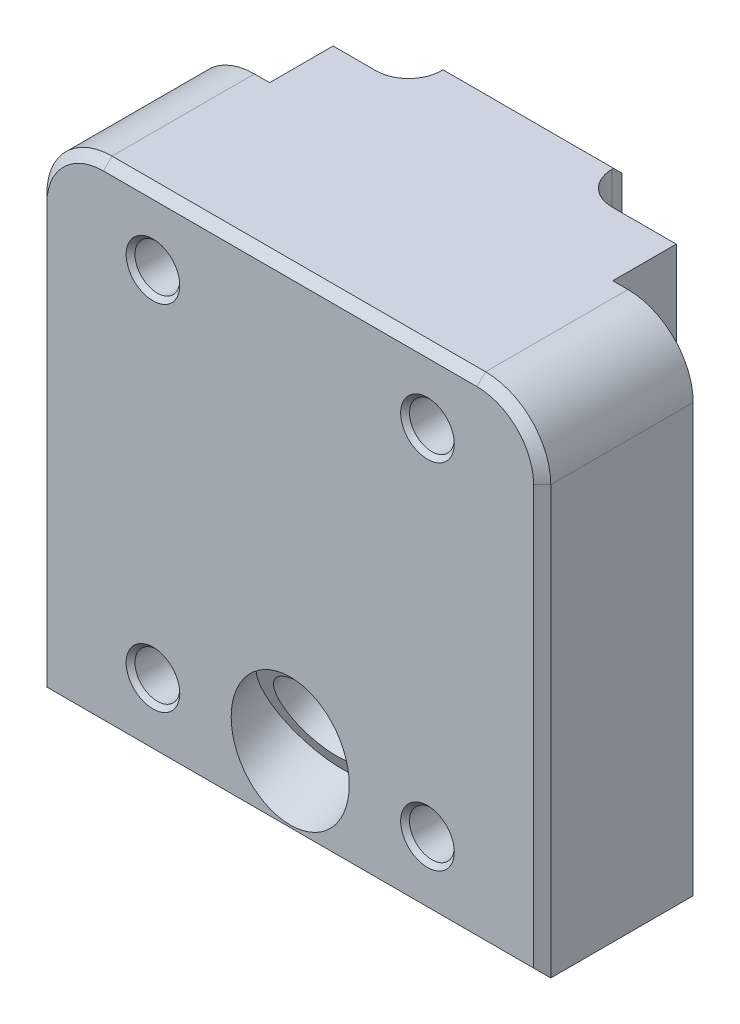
ISO-10303-21;
HEADER;
FILE_DESCRIPTION(('STEP AP214'),'2;1');
FILE_NAME('part.step','',(''),(''),'','','');
FILE_SCHEMA(('AUTOMOTIVE_DESIGN { 1 0 10303 214 1 1 1 1 }'));
ENDSEC;
DATA;
#1=APPLICATION_CONTEXT('core data for automotive mechanical design processes');
#2=APPLICATION_PROTOCOL_DEFINITION('international standard','automotive_design',2000,#1);
#3=PRODUCT_CONTEXT('',#1,'mechanical');
#4=PRODUCT('Part','Part','',(#3));
#5=PRODUCT_RELATED_PRODUCT_CATEGORY('part','',(#4));
#6=PRODUCT_DEFINITION_FORMATION('','',#4);
#7=PRODUCT_DEFINITION_CONTEXT('part definition',#1,'design');
#8=PRODUCT_DEFINITION('design','',#6,#7);
#9=PRODUCT_DEFINITION_SHAPE('','',#8);
#10=(LENGTH_UNIT() NAMED_UNIT(*) SI_UNIT(.MILLI.,.METRE.));
#11=(NAMED_UNIT(*) PLANE_ANGLE_UNIT() SI_UNIT($,.RADIAN.));
#12=(NAMED_UNIT(*) SI_UNIT($,.STERADIAN.) SOLID_ANGLE_UNIT());
#13=UNCERTAINTY_MEASURE_WITH_UNIT(LENGTH_MEASURE(1.E-05),#10,'distance_accuracy_value','');
#14=(GEOMETRIC_REPRESENTATION_CONTEXT(3) GLOBAL_UNCERTAINTY_ASSIGNED_CONTEXT((#13)) GLOBAL_UNIT_ASSIGNED_CONTEXT((#10,
#11,#12)) REPRESENTATION_CONTEXT('',''));
#15=CARTESIAN_POINT('',(0.,0.,0.));
#16=DIRECTION('',(0.,0.,1.));
#17=DIRECTION('',(1.,0.,0.));
#18=AXIS2_PLACEMENT_3D('',#15,#16,#17);
#19=CARTESIAN_POINT('',(0.,72.898,22.352));
#20=DIRECTION('',(0.,0.,-1.));
#21=DIRECTION('',(-1.,0.,0.));
#22=AXIS2_PLACEMENT_3D('',#19,#20,#21);
#23=PLANE('',#22);
#24=DIRECTION('',(0.999999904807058,-0.000436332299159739,0.));
#25=VECTOR('',#24,1.);
#26=CARTESIAN_POINT('',(24.288749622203,62.6092683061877,22.352));
#27=LINE('',#26,#25);
#28=CARTESIAN_POINT('',(24.2890036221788,62.6092681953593,22.352));
#29=VERTEX_POINT('',#28);
#30=CARTESIAN_POINT('',(24.288749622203,62.6092683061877,22.352));
#31=VERTEX_POINT('',#30);
#32=EDGE_CURVE('E1583',#29,#31,#27,.F.);
#33=ORIENTED_EDGE('',*,*,#32,.F.);
#34=CARTESIAN_POINT('',(20.32,62.611,22.352));
#35=DIRECTION('',(0.,0.,1.));
#36=DIRECTION('',(1.,0.,0.));
#37=AXIS2_PLACEMENT_3D('',#34,#35,#36);
#38=CIRCLE('',#37,3.969004);
#39=CARTESIAN_POINT('',(24.289004,62.611,22.352));
#40=VERTEX_POINT('',#39);
#41=EDGE_CURVE('E1547',#40,#29,#38,.T.);
#42=ORIENTED_EDGE('',*,*,#41,.F.);
#43=DIRECTION('',(1.,0.,0.));
#44=VECTOR('',#43,1.);
#45=CARTESIAN_POINT('',(24.28875,62.611,22.352));
#46=LINE('',#45,#44);
#47=CARTESIAN_POINT('',(24.28875,62.611,22.352));
#48=VERTEX_POINT('',#47);
#49=EDGE_CURVE('E1575',#40,#48,#46,.F.);
#50=ORIENTED_EDGE('',*,*,#49,.T.);
#51=CARTESIAN_POINT('',(20.32,62.611,22.352));
#52=DIRECTION('',(0.,0.,-1.));
#53=DIRECTION('',(-1.,0.,0.));
#54=AXIS2_PLACEMENT_3D('',#51,#52,#53);
#55=CIRCLE('',#54,3.96875);
#56=EDGE_CURVE('E1587',#48,#31,#55,.T.);
#57=ORIENTED_EDGE('',*,*,#56,.T.);
#58=EDGE_LOOP('',(#33,#42,#50,#57));
#59=FACE_BOUND('',#58,.T.);
#60=DIRECTION('',(0.999999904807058,-0.00043633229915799,0.));
#61=VECTOR('',#60,1.);
#62=CARTESIAN_POINT('',(-16.351250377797,10.2852683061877,22.352));
#63=LINE('',#62,#61);
#64=CARTESIAN_POINT('',(-16.3509963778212,10.2852681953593,22.352));
#65=VERTEX_POINT('',#64);
#66=CARTESIAN_POINT('',(-16.351250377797,10.2852683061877,22.352));
#67=VERTEX_POINT('',#66);
#68=EDGE_CURVE('E569',#65,#67,#63,.F.);
#69=ORIENTED_EDGE('',*,*,#68,.F.);
#70=CARTESIAN_POINT('',(-20.32,10.287,22.352));
#71=DIRECTION('',(0.,0.,1.));
#72=DIRECTION('',(1.,0.,0.));
#73=AXIS2_PLACEMENT_3D('',#70,#71,#72);
#74=CIRCLE('',#73,3.969004);
#75=CARTESIAN_POINT('',(-16.350996,10.287,22.352));
#76=VERTEX_POINT('',#75);
#77=EDGE_CURVE('E1673',#76,#65,#74,.T.);
#78=ORIENTED_EDGE('',*,*,#77,.F.);
#79=DIRECTION('',(1.,0.,0.));
#80=VECTOR('',#79,1.);
#81=CARTESIAN_POINT('',(-16.35125,10.287,22.352));
#82=LINE('',#81,#80);
#83=CARTESIAN_POINT('',(-16.35125,10.287,22.352));
#84=VERTEX_POINT('',#83);
#85=EDGE_CURVE('E573',#76,#84,#82,.F.);
#86=ORIENTED_EDGE('',*,*,#85,.T.);
#87=CARTESIAN_POINT('',(-20.32,10.287,22.352));
#88=DIRECTION('',(0.,0.,-1.));
#89=DIRECTION('',(-1.,0.,0.));
#90=AXIS2_PLACEMENT_3D('',#87,#88,#89);
#91=CIRCLE('',#90,3.96875);
#92=EDGE_CURVE('E542',#84,#67,#91,.T.);
#93=ORIENTED_EDGE('',*,*,#92,.T.);
#94=EDGE_LOOP('',(#69,#78,#86,#93));
#95=FACE_BOUND('',#94,.T.);
#96=DIRECTION('',(1.,0.,0.));
#97=VECTOR('',#96,1.);
#98=CARTESIAN_POINT('',(37.2999,1.27,22.352));
#99=LINE('',#98,#97);
#100=CARTESIAN_POINT('',(-36.0299,1.27,22.352));
#101=VERTEX_POINT('',#100);
#102=CARTESIAN_POINT('',(36.0299,1.27,22.352));
#103=VERTEX_POINT('',#102);
#104=EDGE_CURVE('E512',#101,#103,#99,.T.);
#105=ORIENTED_EDGE('',*,*,#104,.T.);
#106=DIRECTION('',(0.,1.,0.));
#107=VECTOR('',#106,1.);
#108=CARTESIAN_POINT('',(36.0299,72.898,22.352));
#109=LINE('',#108,#107);
#110=CARTESIAN_POINT('',(36.0299,63.246,22.352));
#111=VERTEX_POINT('',#110);
#112=EDGE_CURVE('E515',#103,#111,#109,.T.);
#113=ORIENTED_EDGE('',*,*,#112,.T.);
#114=CARTESIAN_POINT('',(27.6479,63.246,22.352));
#115=DIRECTION('',(0.,0.,-1.));
#116=DIRECTION('',(-1.,0.,0.));
#117=AXIS2_PLACEMENT_3D('',#114,#115,#116);
#118=CIRCLE('',#117,8.382);
#119=CARTESIAN_POINT('',(27.6479,71.628,22.352));
#120=VERTEX_POINT('',#119);
#121=EDGE_CURVE('E510',#111,#120,#118,.F.);
#122=ORIENTED_EDGE('',*,*,#121,.T.);
#123=DIRECTION('',(-1.,0.,0.));
#124=VECTOR('',#123,1.);
#125=CARTESIAN_POINT('',(0.,71.628,22.352));
#126=LINE('',#125,#124);
#127=CARTESIAN_POINT('',(-27.6479,71.628,22.352));
#128=VERTEX_POINT('',#127);
#129=EDGE_CURVE('E504',#120,#128,#126,.T.);
#130=ORIENTED_EDGE('',*,*,#129,.T.);
#131=CARTESIAN_POINT('',(-27.6479,63.246,22.352));
#132=DIRECTION('',(0.,0.,-1.));
#133=DIRECTION('',(-1.,0.,0.));
#134=AXIS2_PLACEMENT_3D('',#131,#132,#133);
#135=CIRCLE('',#134,8.382);
#136=CARTESIAN_POINT('',(-36.0299,63.246,22.352));
#137=VERTEX_POINT('',#136);
#138=EDGE_CURVE('E506',#128,#137,#135,.F.);
#139=ORIENTED_EDGE('',*,*,#138,.T.);
#140=DIRECTION('',(0.,-1.,0.));
#141=VECTOR('',#140,1.);
#142=CARTESIAN_POINT('',(-36.0299,0.,22.352));
#143=LINE('',#142,#141);
#144=EDGE_CURVE('E508',#137,#101,#143,.T.);
#145=ORIENTED_EDGE('',*,*,#144,.T.);
#146=EDGE_LOOP('',(#105,#113,#122,#130,#139,#145));
#147=FACE_BOUND('',#146,.T.);
#148=CARTESIAN_POINT('',(0.,11.0937104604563,22.352));
#149=DIRECTION('',(0.,0.,-1.));
#150=DIRECTION('',(0.,1.,0.));
#151=AXIS2_PLACEMENT_3D('',#148,#149,#150);
#152=ELLIPSE('',#151,9.49218243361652,8.7376);
#153=CARTESIAN_POINT('',(0.,20.5858928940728,22.352));
#154=VERTEX_POINT('',#153);
#155=EDGE_CURVE('E477',#154,#154,#152,.F.);
#156=ORIENTED_EDGE('',*,*,#155,.F.);
#157=EDGE_LOOP('',(#156));
#158=FACE_BOUND('',#157,.T.);
#159=DIRECTION('',(0.999999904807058,-0.000436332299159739,0.));
#160=VECTOR('',#159,1.);
#161=CARTESIAN_POINT('',(-16.351250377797,62.6092683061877,22.352));
#162=LINE('',#161,#160);
#163=CARTESIAN_POINT('',(-16.3509963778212,62.6092681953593,22.352));
#164=VERTEX_POINT('',#163);
#165=CARTESIAN_POINT('',(-16.351250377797,62.6092683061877,22.352));
#166=VERTEX_POINT('',#165);
#167=EDGE_CURVE('E1696',#164,#166,#162,.F.);
#168=ORIENTED_EDGE('',*,*,#167,.F.);
#169=CARTESIAN_POINT('',(-20.32,62.611,22.352));
#170=DIRECTION('',(0.,0.,1.));
#171=DIRECTION('',(1.,0.,0.));
#172=AXIS2_PLACEMENT_3D('',#169,#170,#171);
#173=CIRCLE('',#172,3.969004);
#174=CARTESIAN_POINT('',(-16.350996,62.611,22.352));
#175=VERTEX_POINT('',#174);
#176=EDGE_CURVE('E1641',#175,#164,#173,.T.);
#177=ORIENTED_EDGE('',*,*,#176,.F.);
#178=DIRECTION('',(1.,0.,0.));
#179=VECTOR('',#178,1.);
#180=CARTESIAN_POINT('',(-16.35125,62.611,22.352));
#181=LINE('',#180,#179);
#182=CARTESIAN_POINT('',(-16.35125,62.611,22.352));
#183=VERTEX_POINT('',#182);
#184=EDGE_CURVE('E1596',#175,#183,#181,.F.);
#185=ORIENTED_EDGE('',*,*,#184,.T.);
#186=CARTESIAN_POINT('',(-20.32,62.611,22.352));
#187=DIRECTION('',(0.,0.,-1.));
#188=DIRECTION('',(-1.,0.,0.));
#189=AXIS2_PLACEMENT_3D('',#186,#187,#188);
#190=CIRCLE('',#189,3.96875);
#191=EDGE_CURVE('E554',#183,#166,#190,.T.);
#192=ORIENTED_EDGE('',*,*,#191,.T.);
#193=EDGE_LOOP('',(#168,#177,#185,#192));
#194=FACE_BOUND('',#193,.T.);
#195=DIRECTION('',(0.999999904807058,-0.000436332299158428,0.));
#196=VECTOR('',#195,1.);
#197=CARTESIAN_POINT('',(24.288749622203,10.2852683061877,22.352));
#198=LINE('',#197,#196);
#199=CARTESIAN_POINT('',(24.2890036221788,10.2852681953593,22.352));
#200=VERTEX_POINT('',#199);
#201=CARTESIAN_POINT('',(24.288749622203,10.2852683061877,22.352));
#202=VERTEX_POINT('',#201);
#203=EDGE_CURVE('E434',#200,#202,#198,.F.);
#204=ORIENTED_EDGE('',*,*,#203,.F.);
#205=CARTESIAN_POINT('',(20.32,10.287,22.352));
#206=DIRECTION('',(0.,0.,1.));
#207=DIRECTION('',(1.,0.,0.));
#208=AXIS2_PLACEMENT_3D('',#205,#206,#207);
#209=CIRCLE('',#208,3.969004);
#210=CARTESIAN_POINT('',(24.289004,10.287,22.352));
#211=VERTEX_POINT('',#210);
#212=EDGE_CURVE('E384',#211,#200,#209,.T.);
#213=ORIENTED_EDGE('',*,*,#212,.F.);
#214=DIRECTION('',(1.,0.,0.));
#215=VECTOR('',#214,1.);
#216=CARTESIAN_POINT('',(24.28875,10.287,22.352));
#217=LINE('',#216,#215);
#218=CARTESIAN_POINT('',(24.28875,10.287,22.352));
#219=VERTEX_POINT('',#218);
#220=EDGE_CURVE('E425',#211,#219,#217,.F.);
#221=ORIENTED_EDGE('',*,*,#220,.T.);
#222=CARTESIAN_POINT('',(20.32,10.287,22.352));
#223=DIRECTION('',(0.,0.,-1.));
#224=DIRECTION('',(-1.,0.,0.));
#225=AXIS2_PLACEMENT_3D('',#222,#223,#224);
#226=CIRCLE('',#225,3.96875);
#227=EDGE_CURVE('E547',#219,#202,#226,.T.);
#228=ORIENTED_EDGE('',*,*,#227,.T.);
#229=EDGE_LOOP('',(#204,#213,#221,#228));
#230=FACE_BOUND('',#229,.T.);
#231=ADVANCED_FACE('F17',(#59,#95,#147,#158,#194,#230),#23,.F.);
#232=CARTESIAN_POINT('',(-25.4,72.898,0.));
#233=DIRECTION('',(-1.,0.,0.));
#234=DIRECTION('',(0.,0.,1.));
#235=AXIS2_PLACEMENT_3D('',#232,#233,#234);
#236=PLANE('',#235);
#237=DIRECTION('',(0.,1.,0.));
#238=VECTOR('',#237,1.);
#239=CARTESIAN_POINT('',(-25.4,72.898,-9.398));
#240=LINE('',#239,#238);
#241=CARTESIAN_POINT('',(-25.4,38.6205643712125,-9.398));
#242=VERTEX_POINT('',#241);
#243=CARTESIAN_POINT('',(-25.4,72.898,-9.398));
#244=VERTEX_POINT('',#243);
#245=EDGE_CURVE('E338',#242,#244,#240,.T.);
#246=ORIENTED_EDGE('',*,*,#245,.F.);
#247=DIRECTION('',(0.,0.438371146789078,-0.898794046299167));
#248=VECTOR('',#247,1.);
#249=CARTESIAN_POINT('',(-25.4,41.5047713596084,-15.3115006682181));
#250=LINE('',#249,#248);
#251=CARTESIAN_POINT('',(-25.4,34.7326222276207,-1.4265372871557));
#252=VERTEX_POINT('',#251);
#253=EDGE_CURVE('E452',#252,#242,#250,.T.);
#254=ORIENTED_EDGE('',*,*,#253,.F.);
#255=CARTESIAN_POINT('',(-25.4,32.4496853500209,-2.53999999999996));
#256=DIRECTION('',(-1.,0.,0.));
#257=DIRECTION('',(0.,0.,1.));
#258=AXIS2_PLACEMENT_3D('',#255,#256,#257);
#259=CIRCLE('',#258,2.54);
#260=CARTESIAN_POINT('',(-25.4,32.4496853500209,0.));
#261=VERTEX_POINT('',#260);
#262=EDGE_CURVE('E535',#252,#261,#259,.F.);
#263=ORIENTED_EDGE('',*,*,#262,.T.);
#264=DIRECTION('',(0.,-1.,0.));
#265=VECTOR('',#264,1.);
#266=CARTESIAN_POINT('',(-25.4,72.898,0.));
#267=LINE('',#266,#265);
#268=CARTESIAN_POINT('',(-25.4,72.898,0.));
#269=VERTEX_POINT('',#268);
#270=EDGE_CURVE('E458',#269,#261,#267,.T.);
#271=ORIENTED_EDGE('',*,*,#270,.F.);
#272=DIRECTION('',(0.,0.,1.));
#273=VECTOR('',#272,1.);
#274=CARTESIAN_POINT('',(-25.4,72.898,0.));
#275=LINE('',#274,#273);
#276=EDGE_CURVE('E457',#244,#269,#275,.T.);
#277=ORIENTED_EDGE('',*,*,#276,.F.);
#278=EDGE_LOOP('',(#246,#254,#263,#271,#277));
#279=FACE_BOUND('',#278,.T.);
#280=ADVANCED_FACE('F454',(#279),#236,.T.);
#281=CARTESIAN_POINT('',(25.4,72.898,0.));
#282=DIRECTION('',(-1.,0.,0.));
#283=DIRECTION('',(0.,0.,1.));
#284=AXIS2_PLACEMENT_3D('',#281,#282,#283);
#285=PLANE('',#284);
#286=DIRECTION('',(0.,0.438371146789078,-0.898794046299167));
#287=VECTOR('',#286,1.);
#288=CARTESIAN_POINT('',(25.4,41.5047713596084,-15.3115006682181));
#289=LINE('',#288,#287);
#290=CARTESIAN_POINT('',(25.4,34.7326222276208,-1.42653728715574));
#291=VERTEX_POINT('',#290);
#292=CARTESIAN_POINT('',(25.4,38.6205643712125,-9.398));
#293=VERTEX_POINT('',#292);
#294=EDGE_CURVE('E616',#291,#293,#289,.T.);
#295=ORIENTED_EDGE('',*,*,#294,.T.);
#296=DIRECTION('',(0.,1.,0.));
#297=VECTOR('',#296,1.);
#298=CARTESIAN_POINT('',(25.4,72.898,-9.398));
#299=LINE('',#298,#297);
#300=CARTESIAN_POINT('',(25.4,72.898,-9.398));
#301=VERTEX_POINT('',#300);
#302=EDGE_CURVE('E375',#293,#301,#299,.T.);
#303=ORIENTED_EDGE('',*,*,#302,.T.);
#304=DIRECTION('',(0.,0.,1.));
#305=VECTOR('',#304,1.);
#306=CARTESIAN_POINT('',(25.4,72.898,0.));
#307=LINE('',#306,#305);
#308=CARTESIAN_POINT('',(25.4,72.898,0.));
#309=VERTEX_POINT('',#308);
#310=EDGE_CURVE('E461',#301,#309,#307,.T.);
#311=ORIENTED_EDGE('',*,*,#310,.T.);
#312=DIRECTION('',(0.,-1.,0.));
#313=VECTOR('',#312,1.);
#314=CARTESIAN_POINT('',(25.4,72.898,0.));
#315=LINE('',#314,#313);
#316=CARTESIAN_POINT('',(25.4,32.4496853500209,0.));
#317=VERTEX_POINT('',#316);
#318=EDGE_CURVE('E628',#309,#317,#315,.T.);
#319=ORIENTED_EDGE('',*,*,#318,.T.);
#320=CARTESIAN_POINT('',(25.4,32.4496853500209,-2.54));
#321=DIRECTION('',(-1.,0.,0.));
#322=DIRECTION('',(0.,0.,1.));
#323=AXIS2_PLACEMENT_3D('',#320,#321,#322);
#324=CIRCLE('',#323,2.54);
#325=EDGE_CURVE('E537',#317,#291,#324,.T.);
#326=ORIENTED_EDGE('',*,*,#325,.T.);
#327=EDGE_LOOP('',(#295,#303,#311,#319,#326));
#328=FACE_BOUND('',#327,.T.);
#329=ADVANCED_FACE('F711',(#328),#285,.F.);
#330=CARTESIAN_POINT('',(25.4,72.898,-15.748));
#331=DIRECTION('',(0.,0.,1.));
#332=DIRECTION('',(1.,0.,0.));
#333=AXIS2_PLACEMENT_3D('',#330,#331,#332);
#334=PLANE('',#333);
#335=DIRECTION('',(-1.,0.,0.));
#336=VECTOR('',#335,1.);
#337=CARTESIAN_POINT('',(25.4,42.3653663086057,-15.748));
#338=LINE('',#337,#336);
#339=CARTESIAN_POINT('',(11.049,42.3653663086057,-15.748));
#340=VERTEX_POINT('',#339);
#341=CARTESIAN_POINT('',(-14.224,42.3653663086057,-15.748));
#342=VERTEX_POINT('',#341);
#343=EDGE_CURVE('E489',#340,#342,#338,.T.);
#344=ORIENTED_EDGE('',*,*,#343,.T.);
#345=DIRECTION('',(0.,1.,0.));
#346=VECTOR('',#345,1.);
#347=CARTESIAN_POINT('',(-14.224,72.898,-15.748));
#348=LINE('',#347,#346);
#349=CARTESIAN_POINT('',(-14.224,71.628,-15.748));
#350=VERTEX_POINT('',#349);
#351=EDGE_CURVE('E347',#342,#350,#348,.T.);
#352=ORIENTED_EDGE('',*,*,#351,.T.);
#353=DIRECTION('',(1.,0.,0.));
#354=VECTOR('',#353,1.);
#355=CARTESIAN_POINT('',(25.4,71.628,-15.748));
#356=LINE('',#355,#354);
#357=CARTESIAN_POINT('',(11.049,71.628,-15.748));
#358=VERTEX_POINT('',#357);
#359=EDGE_CURVE('E40',#350,#358,#356,.T.);
#360=ORIENTED_EDGE('',*,*,#359,.T.);
#361=DIRECTION('',(0.,-1.,0.));
#362=VECTOR('',#361,1.);
#363=CARTESIAN_POINT('',(11.049,72.898,-15.748));
#364=LINE('',#363,#362);
#365=EDGE_CURVE('E367',#358,#340,#364,.T.);
#366=ORIENTED_EDGE('',*,*,#365,.T.);
#367=EDGE_LOOP('',(#344,#352,#360,#366));
#368=FACE_BOUND('',#367,.T.);
#369=ADVANCED_FACE('F724',(#368),#334,.F.);
#370=CARTESIAN_POINT('',(-37.2999,72.898,22.352));
#371=DIRECTION('',(0.,-1.,0.));
#372=DIRECTION('',(0.,0.,-1.));
#373=AXIS2_PLACEMENT_3D('',#370,#371,#372);
#374=PLANE('',#373);
#375=DIRECTION('',(-1.,0.,0.));
#376=VECTOR('',#375,1.);
#377=CARTESIAN_POINT('',(-37.2999,72.898,-14.478));
#378=LINE('',#377,#376);
#379=CARTESIAN_POINT('',(11.049,72.898,-14.478));
#380=VERTEX_POINT('',#379);
#381=CARTESIAN_POINT('',(-14.224,72.898,-14.478));
#382=VERTEX_POINT('',#381);
#383=EDGE_CURVE('E525',#380,#382,#378,.T.);
#384=ORIENTED_EDGE('',*,*,#383,.T.);
#385=DIRECTION('',(0.,0.,-1.));
#386=VECTOR('',#385,1.);
#387=CARTESIAN_POINT('',(-14.224,72.898,-14.224));
#388=LINE('',#387,#386);
#389=CARTESIAN_POINT('',(-14.224,72.898,-14.224));
#390=VERTEX_POINT('',#389);
#391=EDGE_CURVE('E32',#390,#382,#388,.T.);
#392=ORIENTED_EDGE('',*,*,#391,.F.);
#393=CARTESIAN_POINT('',(-19.05,72.898,-14.224));
#394=DIRECTION('',(0.,1.,0.));
#395=DIRECTION('',(0.,0.,1.));
#396=AXIS2_PLACEMENT_3D('',#393,#394,#395);
#397=CIRCLE('',#396,4.826);
#398=CARTESIAN_POINT('',(-19.05,72.898,-9.398));
#399=VERTEX_POINT('',#398);
#400=EDGE_CURVE('E329',#399,#390,#397,.T.);
#401=ORIENTED_EDGE('',*,*,#400,.F.);
#402=DIRECTION('',(1.,0.,0.));
#403=VECTOR('',#402,1.);
#404=CARTESIAN_POINT('',(-32.119065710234,72.898,-9.398));
#405=LINE('',#404,#403);
#406=EDGE_CURVE('E335',#244,#399,#405,.T.);
#407=ORIENTED_EDGE('',*,*,#406,.F.);
#408=ORIENTED_EDGE('',*,*,#276,.T.);
#409=DIRECTION('',(-1.,0.,0.));
#410=VECTOR('',#409,1.);
#411=CARTESIAN_POINT('',(37.2999,72.898,0.));
#412=LINE('',#411,#410);
#413=CARTESIAN_POINT('',(-27.6479,72.898,0.));
#414=VERTEX_POINT('',#413);
#415=EDGE_CURVE('E622',#269,#414,#412,.T.);
#416=ORIENTED_EDGE('',*,*,#415,.T.);
#417=DIRECTION('',(0.,0.,-1.));
#418=VECTOR('',#417,1.);
#419=CARTESIAN_POINT('',(-27.6479,72.898,22.352));
#420=LINE('',#419,#418);
#421=CARTESIAN_POINT('',(-27.6479,72.898,21.082));
#422=VERTEX_POINT('',#421);
#423=EDGE_CURVE('E490',#414,#422,#420,.F.);
#424=ORIENTED_EDGE('',*,*,#423,.T.);
#425=DIRECTION('',(1.,0.,0.));
#426=VECTOR('',#425,1.);
#427=CARTESIAN_POINT('',(-37.2999,72.898,21.082));
#428=LINE('',#427,#426);
#429=CARTESIAN_POINT('',(27.6479,72.898,21.082));
#430=VERTEX_POINT('',#429);
#431=EDGE_CURVE('E527',#422,#430,#428,.T.);
#432=ORIENTED_EDGE('',*,*,#431,.T.);
#433=DIRECTION('',(0.,0.,-1.));
#434=VECTOR('',#433,1.);
#435=CARTESIAN_POINT('',(27.6479,72.898,22.352));
#436=LINE('',#435,#434);
#437=CARTESIAN_POINT('',(27.6479,72.898,0.));
#438=VERTEX_POINT('',#437);
#439=EDGE_CURVE('E493',#430,#438,#436,.T.);
#440=ORIENTED_EDGE('',*,*,#439,.T.);
#441=EDGE_CURVE('E484',#438,#309,#412,.T.);
#442=ORIENTED_EDGE('',*,*,#441,.T.);
#443=ORIENTED_EDGE('',*,*,#310,.F.);
#444=DIRECTION('',(1.,0.,0.));
#445=VECTOR('',#444,1.);
#446=CARTESIAN_POINT('',(15.875,72.898,-9.398));
#447=LINE('',#446,#445);
#448=CARTESIAN_POINT('',(15.875,72.898,-9.398));
#449=VERTEX_POINT('',#448);
#450=EDGE_CURVE('E359',#449,#301,#447,.T.);
#451=ORIENTED_EDGE('',*,*,#450,.F.);
#452=CARTESIAN_POINT('',(15.875,72.898,-14.224));
#453=DIRECTION('',(0.,1.,0.));
#454=DIRECTION('',(0.,0.,-1.));
#455=AXIS2_PLACEMENT_3D('',#452,#453,#454);
#456=CIRCLE('',#455,4.826);
#457=CARTESIAN_POINT('',(11.049,72.898,-14.224));
#458=VERTEX_POINT('',#457);
#459=EDGE_CURVE('E356',#458,#449,#456,.T.);
#460=ORIENTED_EDGE('',*,*,#459,.F.);
#461=DIRECTION('',(0.,0.,1.));
#462=VECTOR('',#461,1.);
#463=CARTESIAN_POINT('',(11.049,72.898,-14.224));
#464=LINE('',#463,#462);
#465=EDGE_CURVE('E361',#380,#458,#464,.T.);
#466=ORIENTED_EDGE('',*,*,#465,.F.);
#467=EDGE_LOOP('',(#384,#392,#401,#407,#408,#416,#424,#432,#440,#442,#443,#451,#460,#466));
#468=FACE_BOUND('',#467,.T.);
#469=ADVANCED_FACE('F343',(#468),#374,.F.);
#470=CARTESIAN_POINT('',(-37.2999,0.,22.352));
#471=DIRECTION('',(0.,-1.,0.));
#472=DIRECTION('',(0.,0.,-1.));
#473=AXIS2_PLACEMENT_3D('',#470,#471,#472);
#474=PLANE('',#473);
#475=DIRECTION('',(0.,0.,-1.));
#476=VECTOR('',#475,1.);
#477=CARTESIAN_POINT('',(37.2999,0.,22.352));
#478=LINE('',#477,#476);
#479=CARTESIAN_POINT('',(37.2999,0.,21.082));
#480=VERTEX_POINT('',#479);
#481=CARTESIAN_POINT('',(37.2999,0.,0.));
#482=VERTEX_POINT('',#481);
#483=EDGE_CURVE('E482',#480,#482,#478,.T.);
#484=ORIENTED_EDGE('',*,*,#483,.F.);
#485=DIRECTION('',(-1.,0.,0.));
#486=VECTOR('',#485,1.);
#487=CARTESIAN_POINT('',(-37.2999,0.,21.082));
#488=LINE('',#487,#486);
#489=CARTESIAN_POINT('',(-37.2999,0.,21.082));
#490=VERTEX_POINT('',#489);
#491=EDGE_CURVE('E501',#480,#490,#488,.T.);
#492=ORIENTED_EDGE('',*,*,#491,.T.);
#493=DIRECTION('',(0.,0.,-1.));
#494=VECTOR('',#493,1.);
#495=CARTESIAN_POINT('',(-37.2999,0.,22.352));
#496=LINE('',#495,#494);
#497=CARTESIAN_POINT('',(-37.2999,0.,0.));
#498=VERTEX_POINT('',#497);
#499=EDGE_CURVE('E486',#490,#498,#496,.T.);
#500=ORIENTED_EDGE('',*,*,#499,.T.);
#501=DIRECTION('',(-1.,0.,0.));
#502=VECTOR('',#501,1.);
#503=CARTESIAN_POINT('',(37.2999,0.,0.));
#504=LINE('',#503,#502);
#505=EDGE_CURVE('E485',#482,#498,#504,.T.);
#506=ORIENTED_EDGE('',*,*,#505,.F.);
#507=EDGE_LOOP('',(#484,#492,#500,#506));
#508=FACE_BOUND('',#507,.T.);
#509=ADVANCED_FACE('F666',(#508),#474,.T.);
#510=CARTESIAN_POINT('',(-37.2999,72.898,22.352));
#511=DIRECTION('',(-1.,0.,0.));
#512=DIRECTION('',(0.,0.,1.));
#513=AXIS2_PLACEMENT_3D('',#510,#511,#512);
#514=PLANE('',#513);
#515=ORIENTED_EDGE('',*,*,#499,.F.);
#516=DIRECTION('',(0.,1.,0.));
#517=VECTOR('',#516,1.);
#518=CARTESIAN_POINT('',(-37.2999,63.246,21.082));
#519=LINE('',#518,#517);
#520=CARTESIAN_POINT('',(-37.2999,63.246,21.082));
#521=VERTEX_POINT('',#520);
#522=EDGE_CURVE('E521',#490,#521,#519,.T.);
#523=ORIENTED_EDGE('',*,*,#522,.T.);
#524=DIRECTION('',(0.,0.,-1.));
#525=VECTOR('',#524,1.);
#526=CARTESIAN_POINT('',(-37.2999,63.246,0.));
#527=LINE('',#526,#525);
#528=CARTESIAN_POINT('',(-37.2999,63.246,0.));
#529=VERTEX_POINT('',#528);
#530=EDGE_CURVE('E481',#521,#529,#527,.T.);
#531=ORIENTED_EDGE('',*,*,#530,.T.);
#532=DIRECTION('',(0.,-1.,0.));
#533=VECTOR('',#532,1.);
#534=CARTESIAN_POINT('',(-37.2999,72.898,0.));
#535=LINE('',#534,#533);
#536=EDGE_CURVE('E494',#529,#498,#535,.T.);
#537=ORIENTED_EDGE('',*,*,#536,.T.);
#538=EDGE_LOOP('',(#515,#523,#531,#537));
#539=FACE_BOUND('',#538,.T.);
#540=ADVANCED_FACE('F669',(#539),#514,.T.);
#541=CARTESIAN_POINT('',(37.2999,72.898,0.));
#542=DIRECTION('',(0.,0.,1.));
#543=DIRECTION('',(1.,0.,0.));
#544=AXIS2_PLACEMENT_3D('',#541,#542,#543);
#545=PLANE('',#544);
#546=ORIENTED_EDGE('',*,*,#270,.T.);
#547=DIRECTION('',(-1.,0.,0.));
#548=VECTOR('',#547,1.);
#549=CARTESIAN_POINT('',(25.4,32.4496853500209,0.));
#550=LINE('',#549,#548);
#551=EDGE_CURVE('E532',#261,#317,#550,.F.);
#552=ORIENTED_EDGE('',*,*,#551,.T.);
#553=ORIENTED_EDGE('',*,*,#318,.F.);
#554=ORIENTED_EDGE('',*,*,#441,.F.);
#555=CARTESIAN_POINT('',(27.6479,63.246,0.));
#556=DIRECTION('',(0.,0.,1.));
#557=DIRECTION('',(1.,0.,0.));
#558=AXIS2_PLACEMENT_3D('',#555,#556,#557);
#559=CIRCLE('',#558,9.652);
#560=CARTESIAN_POINT('',(37.2999,63.246,0.));
#561=VERTEX_POINT('',#560);
#562=EDGE_CURVE('E469',#438,#561,#559,.F.);
#563=ORIENTED_EDGE('',*,*,#562,.T.);
#564=DIRECTION('',(0.,-1.,0.));
#565=VECTOR('',#564,1.);
#566=CARTESIAN_POINT('',(37.2999,72.898,0.));
#567=LINE('',#566,#565);
#568=EDGE_CURVE('E624',#561,#482,#567,.T.);
#569=ORIENTED_EDGE('',*,*,#568,.T.);
#570=ORIENTED_EDGE('',*,*,#505,.T.);
#571=ORIENTED_EDGE('',*,*,#536,.F.);
#572=CARTESIAN_POINT('',(-27.6479,63.246,0.));
#573=DIRECTION('',(0.,0.,1.));
#574=DIRECTION('',(1.,0.,0.));
#575=AXIS2_PLACEMENT_3D('',#572,#573,#574);
#576=CIRCLE('',#575,9.652);
#577=EDGE_CURVE('E496',#529,#414,#576,.F.);
#578=ORIENTED_EDGE('',*,*,#577,.T.);
#579=ORIENTED_EDGE('',*,*,#415,.F.);
#580=EDGE_LOOP('',(#546,#552,#553,#554,#563,#569,#570,#571,#578,#579));
#581=FACE_BOUND('',#580,.T.);
#582=CARTESIAN_POINT('',(0.,20.5815715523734,0.));
#583=DIRECTION('',(0.,0.,1.));
#584=DIRECTION('',(0.,-1.,0.));
#585=AXIS2_PLACEMENT_3D('',#582,#583,#584);
#586=ELLIPSE('',#585,6.90528678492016,6.35635);
#587=CARTESIAN_POINT('',(0.,13.6762847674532,0.));
#588=VERTEX_POINT('',#587);
#589=EDGE_CURVE('E464',#588,#588,#586,.T.);
#590=ORIENTED_EDGE('',*,*,#589,.T.);
#591=EDGE_LOOP('',(#590));
#592=FACE_BOUND('',#591,.T.);
#593=ADVANCED_FACE('F641',(#581,#592),#545,.F.);
#594=CARTESIAN_POINT('',(37.2999,72.898,22.352));
#595=DIRECTION('',(-1.,0.,0.));
#596=DIRECTION('',(0.,0.,1.));
#597=AXIS2_PLACEMENT_3D('',#594,#595,#596);
#598=PLANE('',#597);
#599=DIRECTION('',(0.,0.,-1.));
#600=VECTOR('',#599,1.);
#601=CARTESIAN_POINT('',(37.2999,63.246,22.352));
#602=LINE('',#601,#600);
#603=CARTESIAN_POINT('',(37.2999,63.246,21.082));
#604=VERTEX_POINT('',#603);
#605=EDGE_CURVE('E478',#561,#604,#602,.F.);
#606=ORIENTED_EDGE('',*,*,#605,.T.);
#607=DIRECTION('',(0.,-1.,0.));
#608=VECTOR('',#607,1.);
#609=CARTESIAN_POINT('',(37.2999,72.898,21.082));
#610=LINE('',#609,#608);
#611=EDGE_CURVE('E519',#604,#480,#610,.T.);
#612=ORIENTED_EDGE('',*,*,#611,.T.);
#613=ORIENTED_EDGE('',*,*,#483,.T.);
#614=ORIENTED_EDGE('',*,*,#568,.F.);
#615=EDGE_LOOP('',(#606,#612,#613,#614));
#616=FACE_BOUND('',#615,.T.);
#617=ADVANCED_FACE('F650',(#616),#598,.F.);
#618=CARTESIAN_POINT('',(201.505398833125,34.0368535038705,0.));
#619=DIRECTION('',(0.,0.898794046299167,0.438371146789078));
#620=DIRECTION('',(0.,-0.438371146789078,0.898794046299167));
#621=AXIS2_PLACEMENT_3D('',#618,#619,#620);
#622=PLANE('',#621);
#623=CARTESIAN_POINT('',(-19.05,40.9743618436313,-14.224));
#624=DIRECTION('',(0.,0.898794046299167,0.438371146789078));
#625=DIRECTION('',(0.,0.438371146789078,-0.898794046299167));
#626=AXIS2_PLACEMENT_3D('',#623,#624,#625);
#627=ELLIPSE('',#626,5.36941696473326,4.826);
#628=CARTESIAN_POINT('',(-19.05,38.6205643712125,-9.398));
#629=VERTEX_POINT('',#628);
#630=CARTESIAN_POINT('',(-14.224,40.9743618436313,-14.224));
#631=VERTEX_POINT('',#630);
#632=EDGE_CURVE('E10',#629,#631,#627,.T.);
#633=ORIENTED_EDGE('',*,*,#632,.T.);
#634=DIRECTION('',(0.,0.438371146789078,-0.898794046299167));
#635=VECTOR('',#634,1.);
#636=CARTESIAN_POINT('',(-14.224,34.0368535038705,0.));
#637=LINE('',#636,#635);
#638=CARTESIAN_POINT('',(-14.224,41.1009876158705,-14.4836213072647));
#639=VERTEX_POINT('',#638);
#640=EDGE_CURVE('E352',#631,#639,#637,.T.);
#641=ORIENTED_EDGE('',*,*,#640,.T.);
#642=DIRECTION('',(1.,0.,0.));
#643=VECTOR('',#642,1.);
#644=CARTESIAN_POINT('',(201.505398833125,41.1009876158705,-14.4836213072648));
#645=LINE('',#644,#643);
#646=CARTESIAN_POINT('',(11.049,41.1009876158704,-14.4836213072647));
#647=VERTEX_POINT('',#646);
#648=EDGE_CURVE('E499',#639,#647,#645,.T.);
#649=ORIENTED_EDGE('',*,*,#648,.T.);
#650=DIRECTION('',(0.,-0.438371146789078,0.898794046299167));
#651=VECTOR('',#650,1.);
#652=CARTESIAN_POINT('',(11.049,34.0368535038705,0.));
#653=LINE('',#652,#651);
#654=CARTESIAN_POINT('',(11.049,40.9743618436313,-14.224));
#655=VERTEX_POINT('',#654);
#656=EDGE_CURVE('E372',#647,#655,#653,.T.);
#657=ORIENTED_EDGE('',*,*,#656,.T.);
#658=CARTESIAN_POINT('',(15.875,40.9743618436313,-14.224));
#659=DIRECTION('',(0.,0.898794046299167,0.438371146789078));
#660=DIRECTION('',(0.,0.438371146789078,-0.898794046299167));
#661=AXIS2_PLACEMENT_3D('',#658,#659,#660);
#662=ELLIPSE('',#661,5.36941696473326,4.826);
#663=CARTESIAN_POINT('',(15.875,38.6205643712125,-9.398));
#664=VERTEX_POINT('',#663);
#665=EDGE_CURVE('E443',#655,#664,#662,.T.);
#666=ORIENTED_EDGE('',*,*,#665,.T.);
#667=DIRECTION('',(1.,0.,0.));
#668=VECTOR('',#667,1.);
#669=CARTESIAN_POINT('',(201.505398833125,38.6205643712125,-9.398));
#670=LINE('',#669,#668);
#671=EDGE_CURVE('E439',#664,#293,#670,.T.);
#672=ORIENTED_EDGE('',*,*,#671,.T.);
#673=ORIENTED_EDGE('',*,*,#294,.F.);
#674=DIRECTION('',(-1.,0.,0.));
#675=VECTOR('',#674,1.);
#676=CARTESIAN_POINT('',(-25.4,34.7326222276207,-1.4265372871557));
#677=LINE('',#676,#675);
#678=EDGE_CURVE('E530',#291,#252,#677,.T.);
#679=ORIENTED_EDGE('',*,*,#678,.T.);
#680=ORIENTED_EDGE('',*,*,#253,.T.);
#681=DIRECTION('',(1.,0.,0.));
#682=VECTOR('',#681,1.);
#683=CARTESIAN_POINT('',(201.505398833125,38.6205643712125,-9.398));
#684=LINE('',#683,#682);
#685=EDGE_CURVE('E25',#242,#629,#684,.T.);
#686=ORIENTED_EDGE('',*,*,#685,.T.);
#687=EDGE_LOOP('',(#633,#641,#649,#657,#666,#672,#673,#679,#680,#686));
#688=FACE_BOUND('',#687,.T.);
#689=ADVANCED_FACE('F449',(#688),#622,.F.);
#690=CARTESIAN_POINT('',(0.,2.48561801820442,42.6313949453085));
#691=DIRECTION('',(0.,0.390731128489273,-0.92050485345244));
#692=DIRECTION('',(0.,0.92050485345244,0.390731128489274));
#693=AXIS2_PLACEMENT_3D('',#690,#691,#692);
#694=CYLINDRICAL_SURFACE('',#693,8.7376);
#695=CARTESIAN_POINT('',(0.,12.9293429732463,18.0275208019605));
#696=DIRECTION('',(0.,-0.390731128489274,0.920504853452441));
#697=DIRECTION('',(0.,-0.92050485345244,-0.390731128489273));
#698=AXIS2_PLACEMENT_3D('',#695,#696,#697);
#699=CIRCLE('',#698,8.7376);
#700=CARTESIAN_POINT('',(0.,4.88633976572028,14.6134684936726));
#701=VERTEX_POINT('',#700);
#702=EDGE_CURVE('E473',#701,#701,#699,.T.);
#703=ORIENTED_EDGE('',*,*,#702,.F.);
#704=EDGE_LOOP('',(#703));
#705=FACE_BOUND('',#704,.T.);
#706=ORIENTED_EDGE('',*,*,#155,.T.);
#707=EDGE_LOOP('',(#706));
#708=FACE_BOUND('',#707,.T.);
#709=ADVANCED_FACE('F737',(#705,#708),#694,.F.);
#710=CARTESIAN_POINT('',(0.,12.9293429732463,18.0275208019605));
#711=DIRECTION('',(0.,-0.390731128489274,0.920504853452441));
#712=DIRECTION('',(0.,-0.92050485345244,-0.390731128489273));
#713=AXIS2_PLACEMENT_3D('',#710,#711,#712);
#714=PLANE('',#713);
#715=CARTESIAN_POINT('',(0.,12.9293429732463,18.0275208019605));
#716=DIRECTION('',(0.,-0.390731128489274,0.920504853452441));
#717=DIRECTION('',(0.,-0.92050485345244,-0.390731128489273));
#718=AXIS2_PLACEMENT_3D('',#715,#716,#717);
#719=CIRCLE('',#718,6.35635);
#720=CARTESIAN_POINT('',(0.,7.07829194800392,15.5438969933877));
#721=VERTEX_POINT('',#720);
#722=EDGE_CURVE('E460',#721,#721,#719,.T.);
#723=ORIENTED_EDGE('',*,*,#722,.F.);
#724=EDGE_LOOP('',(#723));
#725=FACE_BOUND('',#724,.T.);
#726=ORIENTED_EDGE('',*,*,#702,.T.);
#727=EDGE_LOOP('',(#726));
#728=FACE_BOUND('',#727,.T.);
#729=ADVANCED_FACE('F733',(#725,#728),#714,.T.);
#730=CARTESIAN_POINT('',(0.,22.3347593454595,-4.1302516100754));
#731=DIRECTION('',(0.,-0.390731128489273,0.92050485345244));
#732=DIRECTION('',(0.,-0.92050485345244,-0.390731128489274));
#733=AXIS2_PLACEMENT_3D('',#730,#731,#732);
#734=CYLINDRICAL_SURFACE('',#733,6.35635);
#735=ORIENTED_EDGE('',*,*,#722,.T.);
#736=EDGE_LOOP('',(#735));
#737=FACE_BOUND('',#736,.T.);
#738=ORIENTED_EDGE('',*,*,#589,.F.);
#739=EDGE_LOOP('',(#738));
#740=FACE_BOUND('',#739,.T.);
#741=ADVANCED_FACE('F730',(#737,#740),#734,.F.);
#742=CARTESIAN_POINT('',(27.6479,63.246,22.352));
#743=DIRECTION('',(0.,0.,-1.));
#744=DIRECTION('',(-1.,0.,0.));
#745=AXIS2_PLACEMENT_3D('',#742,#743,#744);
#746=CYLINDRICAL_SURFACE('',#745,9.652);
#747=ORIENTED_EDGE('',*,*,#439,.F.);
#748=CARTESIAN_POINT('',(27.6479,63.246,21.082));
#749=DIRECTION('',(0.,0.,-1.));
#750=DIRECTION('',(-1.,0.,0.));
#751=AXIS2_PLACEMENT_3D('',#748,#749,#750);
#752=CIRCLE('',#751,9.652);
#753=EDGE_CURVE('E517',#430,#604,#752,.T.);
#754=ORIENTED_EDGE('',*,*,#753,.T.);
#755=ORIENTED_EDGE('',*,*,#605,.F.);
#756=ORIENTED_EDGE('',*,*,#562,.F.);
#757=EDGE_LOOP('',(#747,#754,#755,#756));
#758=FACE_BOUND('',#757,.T.);
#759=ADVANCED_FACE('F653',(#758),#746,.T.);
#760=CARTESIAN_POINT('',(-27.6479,63.246,22.352));
#761=DIRECTION('',(0.,0.,1.));
#762=DIRECTION('',(1.,0.,0.));
#763=AXIS2_PLACEMENT_3D('',#760,#761,#762);
#764=CYLINDRICAL_SURFACE('',#763,9.652);
#765=ORIENTED_EDGE('',*,*,#530,.F.);
#766=CARTESIAN_POINT('',(-27.6479,63.246,21.082));
#767=DIRECTION('',(0.,0.,-1.));
#768=DIRECTION('',(-1.,0.,0.));
#769=AXIS2_PLACEMENT_3D('',#766,#767,#768);
#770=CIRCLE('',#769,9.652);
#771=EDGE_CURVE('E523',#521,#422,#770,.T.);
#772=ORIENTED_EDGE('',*,*,#771,.T.);
#773=ORIENTED_EDGE('',*,*,#423,.F.);
#774=ORIENTED_EDGE('',*,*,#577,.F.);
#775=EDGE_LOOP('',(#765,#772,#773,#774));
#776=FACE_BOUND('',#775,.T.);
#777=ADVANCED_FACE('F674',(#776),#764,.T.);
#778=CARTESIAN_POINT('',(20.32,62.611,5.1816));
#779=DIRECTION('',(0.,0.,1.));
#780=DIRECTION('',(1.,0.,0.));
#781=AXIS2_PLACEMENT_3D('',#778,#779,#780);
#782=CYLINDRICAL_SURFACE('',#781,3.3147);
#783=CARTESIAN_POINT('',(20.32,62.611,21.69795));
#784=DIRECTION('',(0.,0.,-1.));
#785=DIRECTION('',(-1.,0.,0.));
#786=AXIS2_PLACEMENT_3D('',#783,#784,#785);
#787=CIRCLE('',#786,3.3147);
#788=CARTESIAN_POINT('',(17.0053,62.611,21.69795));
#789=VERTEX_POINT('',#788);
#790=EDGE_CURVE('E543',#789,#789,#787,.F.);
#791=ORIENTED_EDGE('',*,*,#790,.T.);
#792=EDGE_LOOP('',(#791));
#793=FACE_BOUND('',#792,.T.);
#794=CARTESIAN_POINT('',(20.32,62.611,5.207));
#795=DIRECTION('',(0.,0.,-1.));
#796=DIRECTION('',(-1.,0.,0.));
#797=AXIS2_PLACEMENT_3D('',#794,#795,#796);
#798=CIRCLE('',#797,3.3147);
#799=CARTESIAN_POINT('',(17.0053,62.611,5.207));
#800=VERTEX_POINT('',#799);
#801=EDGE_CURVE('E611',#800,#800,#798,.T.);
#802=ORIENTED_EDGE('',*,*,#801,.T.);
#803=EDGE_LOOP('',(#802));
#804=FACE_BOUND('',#803,.T.);
#805=ADVANCED_FACE('F747',(#793,#804),#782,.F.);
#806=CARTESIAN_POINT('',(20.32,10.287,5.1816));
#807=DIRECTION('',(0.,0.,1.));
#808=DIRECTION('',(1.,0.,0.));
#809=AXIS2_PLACEMENT_3D('',#806,#807,#808);
#810=CYLINDRICAL_SURFACE('',#809,3.3147);
#811=CARTESIAN_POINT('',(20.32,10.287,21.69795));
#812=DIRECTION('',(0.,0.,-1.));
#813=DIRECTION('',(-1.,0.,0.));
#814=AXIS2_PLACEMENT_3D('',#811,#812,#813);
#815=CIRCLE('',#814,3.3147);
#816=CARTESIAN_POINT('',(17.0053,10.287,21.69795));
#817=VERTEX_POINT('',#816);
#818=EDGE_CURVE('E539',#817,#817,#815,.F.);
#819=ORIENTED_EDGE('',*,*,#818,.T.);
#820=EDGE_LOOP('',(#819));
#821=FACE_BOUND('',#820,.T.);
#822=CARTESIAN_POINT('',(20.32,10.287,5.207));
#823=DIRECTION('',(0.,0.,-1.));
#824=DIRECTION('',(-1.,0.,0.));
#825=AXIS2_PLACEMENT_3D('',#822,#823,#824);
#826=CIRCLE('',#825,3.3147);
#827=CARTESIAN_POINT('',(17.0053,10.287,5.207));
#828=VERTEX_POINT('',#827);
#829=EDGE_CURVE('E605',#828,#828,#826,.T.);
#830=ORIENTED_EDGE('',*,*,#829,.T.);
#831=EDGE_LOOP('',(#830));
#832=FACE_BOUND('',#831,.T.);
#833=ADVANCED_FACE('F19',(#821,#832),#810,.F.);
#834=CARTESIAN_POINT('',(-20.32,10.287,5.1816));
#835=DIRECTION('',(0.,0.,1.));
#836=DIRECTION('',(1.,0.,0.));
#837=AXIS2_PLACEMENT_3D('',#834,#835,#836);
#838=CYLINDRICAL_SURFACE('',#837,3.3147);
#839=CARTESIAN_POINT('',(-20.32,10.287,21.69795));
#840=DIRECTION('',(0.,0.,-1.));
#841=DIRECTION('',(-1.,0.,0.));
#842=AXIS2_PLACEMENT_3D('',#839,#840,#841);
#843=CIRCLE('',#842,3.3147);
#844=CARTESIAN_POINT('',(-23.6347,10.287,21.69795));
#845=VERTEX_POINT('',#844);
#846=EDGE_CURVE('E440',#845,#845,#843,.F.);
#847=ORIENTED_EDGE('',*,*,#846,.T.);
#848=EDGE_LOOP('',(#847));
#849=FACE_BOUND('',#848,.T.);
#850=CARTESIAN_POINT('',(-20.32,10.287,5.207));
#851=DIRECTION('',(0.,0.,-1.));
#852=DIRECTION('',(-1.,0.,0.));
#853=AXIS2_PLACEMENT_3D('',#850,#851,#852);
#854=CIRCLE('',#853,3.3147);
#855=CARTESIAN_POINT('',(-23.6347,10.287,5.207));
#856=VERTEX_POINT('',#855);
#857=EDGE_CURVE('E608',#856,#856,#854,.T.);
#858=ORIENTED_EDGE('',*,*,#857,.T.);
#859=EDGE_LOOP('',(#858));
#860=FACE_BOUND('',#859,.T.);
#861=ADVANCED_FACE('F739',(#849,#860),#838,.F.);
#862=CARTESIAN_POINT('',(-20.32,62.611,5.1816));
#863=DIRECTION('',(0.,0.,1.));
#864=DIRECTION('',(1.,0.,0.));
#865=AXIS2_PLACEMENT_3D('',#862,#863,#864);
#866=CYLINDRICAL_SURFACE('',#865,3.3147);
#867=CARTESIAN_POINT('',(-20.32,62.611,21.69795));
#868=DIRECTION('',(0.,0.,-1.));
#869=DIRECTION('',(-1.,0.,0.));
#870=AXIS2_PLACEMENT_3D('',#867,#868,#869);
#871=CIRCLE('',#870,3.3147);
#872=CARTESIAN_POINT('',(-23.6347,62.611,21.69795));
#873=VERTEX_POINT('',#872);
#874=EDGE_CURVE('E546',#873,#873,#871,.F.);
#875=ORIENTED_EDGE('',*,*,#874,.T.);
#876=EDGE_LOOP('',(#875));
#877=FACE_BOUND('',#876,.T.);
#878=CARTESIAN_POINT('',(-20.32,62.611,5.207));
#879=DIRECTION('',(0.,0.,-1.));
#880=DIRECTION('',(-1.,0.,0.));
#881=AXIS2_PLACEMENT_3D('',#878,#879,#880);
#882=CIRCLE('',#881,3.3147);
#883=CARTESIAN_POINT('',(-23.6347,62.611,5.207));
#884=VERTEX_POINT('',#883);
#885=EDGE_CURVE('E466',#884,#884,#882,.T.);
#886=ORIENTED_EDGE('',*,*,#885,.T.);
#887=EDGE_LOOP('',(#886));
#888=FACE_BOUND('',#887,.T.);
#889=ADVANCED_FACE('F742',(#877,#888),#866,.F.);
#890=CARTESIAN_POINT('',(-20.32,62.611,5.207));
#891=DIRECTION('',(0.,0.,1.));
#892=DIRECTION('',(1.,0.,0.));
#893=AXIS2_PLACEMENT_3D('',#890,#891,#892);
#894=CONICAL_SURFACE('',#893,3.3147,1.02974425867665);
#895=ORIENTED_EDGE('',*,*,#885,.F.);
#896=EDGE_LOOP('',(#895));
#897=FACE_BOUND('',#896,.T.);
#898=CARTESIAN_POINT('',(-20.32,62.611,3.21532730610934));
#899=VERTEX_POINT('',#898);
#900=VERTEX_LOOP('',#899);
#901=FACE_BOUND('',#900,.T.);
#902=ADVANCED_FACE('F745',(#897,#901),#894,.F.);
#903=CARTESIAN_POINT('',(20.32,62.611,5.207));
#904=DIRECTION('',(0.,0.,1.));
#905=DIRECTION('',(1.,0.,0.));
#906=AXIS2_PLACEMENT_3D('',#903,#904,#905);
#907=CONICAL_SURFACE('',#906,3.3147,1.02974425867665);
#908=ORIENTED_EDGE('',*,*,#801,.F.);
#909=EDGE_LOOP('',(#908));
#910=FACE_BOUND('',#909,.T.);
#911=CARTESIAN_POINT('',(20.32,62.611,3.21532730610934));
#912=VERTEX_POINT('',#911);
#913=VERTEX_LOOP('',#912);
#914=FACE_BOUND('',#913,.T.);
#915=ADVANCED_FACE('F761',(#910,#914),#907,.F.);
#916=CARTESIAN_POINT('',(-20.32,10.287,5.207));
#917=DIRECTION('',(0.,0.,1.));
#918=DIRECTION('',(1.,0.,0.));
#919=AXIS2_PLACEMENT_3D('',#916,#917,#918);
#920=CONICAL_SURFACE('',#919,3.3147,1.02974425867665);
#921=ORIENTED_EDGE('',*,*,#857,.F.);
#922=EDGE_LOOP('',(#921));
#923=FACE_BOUND('',#922,.T.);
#924=CARTESIAN_POINT('',(-20.32,10.287,3.21532730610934));
#925=VERTEX_POINT('',#924);
#926=VERTEX_LOOP('',#925);
#927=FACE_BOUND('',#926,.T.);
#928=ADVANCED_FACE('F764',(#923,#927),#920,.F.);
#929=CARTESIAN_POINT('',(20.32,10.287,5.207));
#930=DIRECTION('',(0.,0.,1.));
#931=DIRECTION('',(1.,0.,0.));
#932=AXIS2_PLACEMENT_3D('',#929,#930,#931);
#933=CONICAL_SURFACE('',#932,3.3147,1.02974425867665);
#934=ORIENTED_EDGE('',*,*,#829,.F.);
#935=EDGE_LOOP('',(#934));
#936=FACE_BOUND('',#935,.T.);
#937=CARTESIAN_POINT('',(20.32,10.287,3.21532730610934));
#938=VERTEX_POINT('',#937);
#939=VERTEX_LOOP('',#938);
#940=FACE_BOUND('',#939,.T.);
#941=ADVANCED_FACE('F771',(#936,#940),#933,.F.);
#942=CARTESIAN_POINT('',(25.4,42.3653663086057,-15.748));
#943=DIRECTION('',(0.,0.707106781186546,0.707106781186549));
#944=DIRECTION('',(0.,-0.707106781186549,0.707106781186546));
#945=AXIS2_PLACEMENT_3D('',#942,#943,#944);
#946=PLANE('',#945);
#947=DIRECTION('',(0.,0.707106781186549,-0.707106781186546));
#948=VECTOR('',#947,1.);
#949=CARTESIAN_POINT('',(-14.224,42.3653663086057,-15.748));
#950=LINE('',#949,#948);
#951=EDGE_CURVE('E350',#342,#639,#950,.F.);
#952=ORIENTED_EDGE('',*,*,#951,.F.);
#953=ORIENTED_EDGE('',*,*,#343,.F.);
#954=DIRECTION('',(0.,-0.707106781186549,0.707106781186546));
#955=VECTOR('',#954,1.);
#956=CARTESIAN_POINT('',(11.049,42.3653663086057,-15.748));
#957=LINE('',#956,#955);
#958=EDGE_CURVE('E370',#647,#340,#957,.F.);
#959=ORIENTED_EDGE('',*,*,#958,.F.);
#960=ORIENTED_EDGE('',*,*,#648,.F.);
#961=EDGE_LOOP('',(#952,#953,#959,#960));
#962=FACE_BOUND('',#961,.T.);
#963=ADVANCED_FACE('F1283',(#962),#946,.F.);
#964=CARTESIAN_POINT('',(0.,71.628,22.352));
#965=DIRECTION('',(0.,-0.707106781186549,-0.707106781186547));
#966=DIRECTION('',(0.,0.707106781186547,-0.707106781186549));
#967=AXIS2_PLACEMENT_3D('',#964,#965,#966);
#968=PLANE('',#967);
#969=DIRECTION('',(0.,0.707106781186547,-0.707106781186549));
#970=VECTOR('',#969,1.);
#971=CARTESIAN_POINT('',(-27.6479,71.628,22.352));
#972=LINE('',#971,#970);
#973=EDGE_CURVE('E599',#128,#422,#972,.T.);
#974=ORIENTED_EDGE('',*,*,#973,.F.);
#975=ORIENTED_EDGE('',*,*,#129,.F.);
#976=DIRECTION('',(0.,-0.707106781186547,0.707106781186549));
#977=VECTOR('',#976,1.);
#978=CARTESIAN_POINT('',(27.6479,72.898,21.082));
#979=LINE('',#978,#977);
#980=EDGE_CURVE('E602',#430,#120,#979,.T.);
#981=ORIENTED_EDGE('',*,*,#980,.F.);
#982=ORIENTED_EDGE('',*,*,#431,.F.);
#983=EDGE_LOOP('',(#974,#975,#981,#982));
#984=FACE_BOUND('',#983,.T.);
#985=ADVANCED_FACE('F678',(#984),#968,.F.);
#986=CARTESIAN_POINT('',(27.6479,63.246,22.352));
#987=DIRECTION('',(0.,0.,-1.));
#988=DIRECTION('',(-1.,0.,0.));
#989=AXIS2_PLACEMENT_3D('',#986,#987,#988);
#990=CONICAL_SURFACE('',#989,8.382,0.785398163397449);
#991=ORIENTED_EDGE('',*,*,#980,.T.);
#992=ORIENTED_EDGE('',*,*,#121,.F.);
#993=DIRECTION('',(-0.707106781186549,0.,0.707106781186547));
#994=VECTOR('',#993,1.);
#995=CARTESIAN_POINT('',(37.2999,63.246,21.082));
#996=LINE('',#995,#994);
#997=EDGE_CURVE('E596',#604,#111,#996,.T.);
#998=ORIENTED_EDGE('',*,*,#997,.F.);
#999=ORIENTED_EDGE('',*,*,#753,.F.);
#1000=EDGE_LOOP('',(#991,#992,#998,#999));
#1001=FACE_BOUND('',#1000,.T.);
#1002=ADVANCED_FACE('F657',(#1001),#990,.T.);
#1003=CARTESIAN_POINT('',(-27.6479,63.246,21.082));
#1004=DIRECTION('',(0.,0.,-1.));
#1005=DIRECTION('',(-1.,0.,0.));
#1006=AXIS2_PLACEMENT_3D('',#1003,#1004,#1005);
#1007=CONICAL_SURFACE('',#1006,9.652,0.785398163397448);
#1008=ORIENTED_EDGE('',*,*,#973,.T.);
#1009=ORIENTED_EDGE('',*,*,#771,.F.);
#1010=DIRECTION('',(-0.707106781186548,0.,-0.707106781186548));
#1011=VECTOR('',#1010,1.);
#1012=CARTESIAN_POINT('',(-36.0299,63.246,22.352));
#1013=LINE('',#1012,#1011);
#1014=EDGE_CURVE('E593',#137,#521,#1013,.T.);
#1015=ORIENTED_EDGE('',*,*,#1014,.F.);
#1016=ORIENTED_EDGE('',*,*,#138,.F.);
#1017=EDGE_LOOP('',(#1008,#1009,#1015,#1016));
#1018=FACE_BOUND('',#1017,.T.);
#1019=ADVANCED_FACE('F682',(#1018),#1007,.T.);
#1020=CARTESIAN_POINT('',(36.0299,72.898,22.352));
#1021=DIRECTION('',(-0.707106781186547,0.,-0.707106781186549));
#1022=DIRECTION('',(-0.707106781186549,0.,0.707106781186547));
#1023=AXIS2_PLACEMENT_3D('',#1020,#1021,#1022);
#1024=PLANE('',#1023);
#1025=ORIENTED_EDGE('',*,*,#997,.T.);
#1026=ORIENTED_EDGE('',*,*,#112,.F.);
#1027=DIRECTION('',(-0.577350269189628,0.577350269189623,0.577350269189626));
#1028=VECTOR('',#1027,1.);
#1029=CARTESIAN_POINT('',(12.1539,25.146,46.228));
#1030=LINE('',#1029,#1028);
#1031=EDGE_CURVE('E591',#480,#103,#1030,.T.);
#1032=ORIENTED_EDGE('',*,*,#1031,.F.);
#1033=ORIENTED_EDGE('',*,*,#611,.F.);
#1034=EDGE_LOOP('',(#1025,#1026,#1032,#1033));
#1035=FACE_BOUND('',#1034,.T.);
#1036=ADVANCED_FACE('F663',(#1035),#1024,.F.);
#1037=CARTESIAN_POINT('',(-37.2999,72.898,21.082));
#1038=DIRECTION('',(-0.707106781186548,0.,0.707106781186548));
#1039=DIRECTION('',(0.707106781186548,0.,0.707106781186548));
#1040=AXIS2_PLACEMENT_3D('',#1037,#1038,#1039);
#1041=PLANE('',#1040);
#1042=ORIENTED_EDGE('',*,*,#1014,.T.);
#1043=ORIENTED_EDGE('',*,*,#522,.F.);
#1044=DIRECTION('',(0.577350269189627,0.577350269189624,0.577350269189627));
#1045=VECTOR('',#1044,1.);
#1046=CARTESIAN_POINT('',(-13.0005666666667,24.2993333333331,45.3813333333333));
#1047=LINE('',#1046,#1045);
#1048=EDGE_CURVE('E572',#101,#490,#1047,.F.);
#1049=ORIENTED_EDGE('',*,*,#1048,.F.);
#1050=ORIENTED_EDGE('',*,*,#144,.F.);
#1051=EDGE_LOOP('',(#1042,#1043,#1049,#1050));
#1052=FACE_BOUND('',#1051,.T.);
#1053=ADVANCED_FACE('F692',(#1052),#1041,.T.);
#1054=CARTESIAN_POINT('',(-37.2999,0.,21.082));
#1055=DIRECTION('',(0.,-0.70710678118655,0.707106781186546));
#1056=DIRECTION('',(0.,-0.707106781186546,-0.70710678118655));
#1057=AXIS2_PLACEMENT_3D('',#1054,#1055,#1056);
#1058=PLANE('',#1057);
#1059=ORIENTED_EDGE('',*,*,#1031,.T.);
#1060=ORIENTED_EDGE('',*,*,#104,.F.);
#1061=ORIENTED_EDGE('',*,*,#1048,.T.);
#1062=ORIENTED_EDGE('',*,*,#491,.F.);
#1063=EDGE_LOOP('',(#1059,#1060,#1061,#1062));
#1064=FACE_BOUND('',#1063,.T.);
#1065=ADVANCED_FACE('F690',(#1064),#1058,.T.);
#1066=CARTESIAN_POINT('',(-37.2999,72.898,-14.478));
#1067=DIRECTION('',(0.,-0.70710678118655,0.707106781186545));
#1068=DIRECTION('',(0.,-0.707106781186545,-0.70710678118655));
#1069=AXIS2_PLACEMENT_3D('',#1066,#1067,#1068);
#1070=PLANE('',#1069);
#1071=DIRECTION('',(0.,0.707106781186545,0.70710678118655));
#1072=VECTOR('',#1071,1.);
#1073=CARTESIAN_POINT('',(-14.224,72.898,-14.478));
#1074=LINE('',#1073,#1072);
#1075=EDGE_CURVE('E446',#382,#350,#1074,.F.);
#1076=ORIENTED_EDGE('',*,*,#1075,.F.);
#1077=ORIENTED_EDGE('',*,*,#383,.F.);
#1078=DIRECTION('',(0.,-0.707106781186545,-0.70710678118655));
#1079=VECTOR('',#1078,1.);
#1080=CARTESIAN_POINT('',(11.049,72.898,-14.478));
#1081=LINE('',#1080,#1079);
#1082=EDGE_CURVE('E437',#358,#380,#1081,.F.);
#1083=ORIENTED_EDGE('',*,*,#1082,.F.);
#1084=ORIENTED_EDGE('',*,*,#359,.F.);
#1085=EDGE_LOOP('',(#1076,#1077,#1083,#1084));
#1086=FACE_BOUND('',#1085,.T.);
#1087=ADVANCED_FACE('F701',(#1086),#1070,.F.);
#1088=CARTESIAN_POINT('',(201.505398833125,32.4496853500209,-2.54000000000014));
#1089=DIRECTION('',(1.,0.,0.));
#1090=DIRECTION('',(0.,0.,-1.));
#1091=AXIS2_PLACEMENT_3D('',#1088,#1089,#1090);
#1092=CYLINDRICAL_SURFACE('',#1091,2.54);
#1093=ORIENTED_EDGE('',*,*,#325,.F.);
#1094=ORIENTED_EDGE('',*,*,#551,.F.);
#1095=ORIENTED_EDGE('',*,*,#262,.F.);
#1096=ORIENTED_EDGE('',*,*,#678,.F.);
#1097=EDGE_LOOP('',(#1093,#1094,#1095,#1096));
#1098=FACE_BOUND('',#1097,.T.);
#1099=ADVANCED_FACE('F854',(#1098),#1092,.F.);
#1100=CARTESIAN_POINT('',(20.32,10.287,21.69795));
#1101=DIRECTION('',(0.,0.,1.));
#1102=DIRECTION('',(1.,0.,0.));
#1103=AXIS2_PLACEMENT_3D('',#1100,#1101,#1102);
#1104=CONICAL_SURFACE('',#1103,3.3147,0.785398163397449);
#1105=ORIENTED_EDGE('',*,*,#227,.F.);
#1106=CARTESIAN_POINT('',(20.32,10.287,22.352));
#1107=DIRECTION('',(0.,0.,1.));
#1108=DIRECTION('',(1.,0.,0.));
#1109=AXIS2_PLACEMENT_3D('',#1106,#1107,#1108);
#1110=CIRCLE('',#1109,3.96875);
#1111=EDGE_CURVE('E1532',#219,#202,#1110,.T.);
#1112=ORIENTED_EDGE('',*,*,#1111,.T.);
#1113=EDGE_LOOP('',(#1105,#1112));
#1114=FACE_BOUND('',#1113,.T.);
#1115=ORIENTED_EDGE('',*,*,#818,.F.);
#1116=EDGE_LOOP('',(#1115));
#1117=FACE_BOUND('',#1116,.T.);
#1118=ADVANCED_FACE('F866',(#1114,#1117),#1104,.F.);
#1119=CARTESIAN_POINT('',(20.32,62.611,21.69795));
#1120=DIRECTION('',(0.,0.,1.));
#1121=DIRECTION('',(1.,0.,0.));
#1122=AXIS2_PLACEMENT_3D('',#1119,#1120,#1121);
#1123=CONICAL_SURFACE('',#1122,3.3147,0.785398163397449);
#1124=ORIENTED_EDGE('',*,*,#56,.F.);
#1125=CARTESIAN_POINT('',(20.32,62.611,22.352));
#1126=DIRECTION('',(0.,0.,1.));
#1127=DIRECTION('',(1.,0.,0.));
#1128=AXIS2_PLACEMENT_3D('',#1125,#1126,#1127);
#1129=CIRCLE('',#1128,3.96875);
#1130=EDGE_CURVE('E1604',#48,#31,#1129,.T.);
#1131=ORIENTED_EDGE('',*,*,#1130,.T.);
#1132=EDGE_LOOP('',(#1124,#1131));
#1133=FACE_BOUND('',#1132,.T.);
#1134=ORIENTED_EDGE('',*,*,#790,.F.);
#1135=EDGE_LOOP('',(#1134));
#1136=FACE_BOUND('',#1135,.T.);
#1137=ADVANCED_FACE('F878',(#1133,#1136),#1123,.F.);
#1138=CARTESIAN_POINT('',(-20.32,62.611,21.69795));
#1139=DIRECTION('',(0.,0.,1.));
#1140=DIRECTION('',(1.,0.,0.));
#1141=AXIS2_PLACEMENT_3D('',#1138,#1139,#1140);
#1142=CONICAL_SURFACE('',#1141,3.3147,0.785398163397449);
#1143=ORIENTED_EDGE('',*,*,#191,.F.);
#1144=CARTESIAN_POINT('',(-20.32,62.611,22.352));
#1145=DIRECTION('',(0.,0.,1.));
#1146=DIRECTION('',(1.,0.,0.));
#1147=AXIS2_PLACEMENT_3D('',#1144,#1145,#1146);
#1148=CIRCLE('',#1147,3.96875);
#1149=EDGE_CURVE('E1739',#183,#166,#1148,.T.);
#1150=ORIENTED_EDGE('',*,*,#1149,.T.);
#1151=EDGE_LOOP('',(#1143,#1150));
#1152=FACE_BOUND('',#1151,.T.);
#1153=ORIENTED_EDGE('',*,*,#874,.F.);
#1154=EDGE_LOOP('',(#1153));
#1155=FACE_BOUND('',#1154,.T.);
#1156=ADVANCED_FACE('F889',(#1152,#1155),#1142,.F.);
#1157=CARTESIAN_POINT('',(-20.32,10.287,21.69795));
#1158=DIRECTION('',(0.,0.,1.));
#1159=DIRECTION('',(1.,0.,0.));
#1160=AXIS2_PLACEMENT_3D('',#1157,#1158,#1159);
#1161=CONICAL_SURFACE('',#1160,3.3147,0.785398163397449);
#1162=ORIENTED_EDGE('',*,*,#92,.F.);
#1163=CARTESIAN_POINT('',(-20.32,10.287,22.352));
#1164=DIRECTION('',(0.,0.,1.));
#1165=DIRECTION('',(1.,0.,0.));
#1166=AXIS2_PLACEMENT_3D('',#1163,#1164,#1165);
#1167=CIRCLE('',#1166,3.96875);
#1168=EDGE_CURVE('E560',#84,#67,#1167,.T.);
#1169=ORIENTED_EDGE('',*,*,#1168,.T.);
#1170=EDGE_LOOP('',(#1162,#1169));
#1171=FACE_BOUND('',#1170,.T.);
#1172=ORIENTED_EDGE('',*,*,#846,.F.);
#1173=EDGE_LOOP('',(#1172));
#1174=FACE_BOUND('',#1173,.T.);
#1175=ADVANCED_FACE('F900',(#1171,#1174),#1161,.F.);
#1176=CARTESIAN_POINT('',(-16.35125,10.287,7.112));
#1177=DIRECTION('',(0.,-1.,0.));
#1178=DIRECTION('',(-0.5,0.,-0.866025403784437));
#1179=AXIS2_PLACEMENT_3D('',#1176,#1177,#1178);
#1180=PLANE('',#1179);
#1181=DIRECTION('',(0.5,0.,0.866025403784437));
#1182=VECTOR('',#1181,1.);
#1183=CARTESIAN_POINT('',(-16.3510300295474,10.287,7.111873));
#1184=LINE('',#1183,#1182);
#1185=CARTESIAN_POINT('',(-16.350996,10.287,7.112));
#1186=VERTEX_POINT('',#1185);
#1187=CARTESIAN_POINT('',(-16.9923800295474,10.287,6.00102221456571));
#1188=VERTEX_POINT('',#1187);
#1189=EDGE_CURVE('E1672',#1186,#1188,#1184,.F.);
#1190=ORIENTED_EDGE('',*,*,#1189,.T.);
#1191=DIRECTION('',(0.866025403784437,0.,-0.5));
#1192=VECTOR('',#1191,1.);
#1193=CARTESIAN_POINT('',(-16.9926,10.287,6.00114921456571));
#1194=LINE('',#1193,#1192);
#1195=CARTESIAN_POINT('',(-16.9926,10.287,6.00114921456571));
#1196=VERTEX_POINT('',#1195);
#1197=EDGE_CURVE('E584',#1188,#1196,#1194,.F.);
#1198=ORIENTED_EDGE('',*,*,#1197,.T.);
#1199=DIRECTION('',(-0.5,0.,-0.866025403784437));
#1200=VECTOR('',#1199,1.);
#1201=CARTESIAN_POINT('',(-16.35125,10.287,7.112));
#1202=LINE('',#1201,#1200);
#1203=CARTESIAN_POINT('',(-16.35125,10.287,7.112));
#1204=VERTEX_POINT('',#1203);
#1205=EDGE_CURVE('E1701',#1204,#1196,#1202,.T.);
#1206=ORIENTED_EDGE('',*,*,#1205,.F.);
#1207=DIRECTION('',(0.,0.,-1.));
#1208=VECTOR('',#1207,1.);
#1209=CARTESIAN_POINT('',(-16.35125,10.287,22.352));
#1210=LINE('',#1209,#1208);
#1211=EDGE_CURVE('E566',#84,#1204,#1210,.T.);
#1212=ORIENTED_EDGE('',*,*,#1211,.F.);
#1213=ORIENTED_EDGE('',*,*,#85,.F.);
#1214=DIRECTION('',(0.,0.,1.));
#1215=VECTOR('',#1214,1.);
#1216=CARTESIAN_POINT('',(-16.350996,10.287,22.352));
#1217=LINE('',#1216,#1215);
#1218=EDGE_CURVE('E1676',#76,#1186,#1217,.F.);
#1219=ORIENTED_EDGE('',*,*,#1218,.T.);
#1220=EDGE_LOOP('',(#1190,#1198,#1206,#1212,#1213,#1219));
#1221=FACE_BOUND('',#1220,.T.);
#1222=ADVANCED_FACE('F911',(#1221),#1180,.F.);
#1223=CARTESIAN_POINT('',(-20.32,10.287,6.00114921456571));
#1224=DIRECTION('',(0.,0.,-1.));
#1225=DIRECTION('',(-1.,0.,0.));
#1226=AXIS2_PLACEMENT_3D('',#1223,#1224,#1225);
#1227=CONICAL_SURFACE('',#1226,3.3274,1.0471975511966);
#1228=ORIENTED_EDGE('',*,*,#1197,.F.);
#1229=CARTESIAN_POINT('',(-20.32,10.287,6.00102221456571));
#1230=DIRECTION('',(0.,0.,1.));
#1231=DIRECTION('',(1.,0.,0.));
#1232=AXIS2_PLACEMENT_3D('',#1229,#1230,#1231);
#1233=CIRCLE('',#1232,3.32761997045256);
#1234=CARTESIAN_POINT('',(-16.9923803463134,10.2855480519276,6.00102221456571));
#1235=VERTEX_POINT('',#1234);
#1236=EDGE_CURVE('E561',#1188,#1235,#1233,.T.);
#1237=ORIENTED_EDGE('',*,*,#1236,.T.);
#1238=DIRECTION('',(0.866025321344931,-0.000377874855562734,-0.5));
#1239=VECTOR('',#1238,1.);
#1240=CARTESIAN_POINT('',(-16.992600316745,10.2855481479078,6.00114921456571));
#1241=LINE('',#1240,#1239);
#1242=CARTESIAN_POINT('',(-16.992600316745,10.2855481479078,6.00114921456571));
#1243=VERTEX_POINT('',#1242);
#1244=EDGE_CURVE('E1707',#1235,#1243,#1241,.F.);
#1245=ORIENTED_EDGE('',*,*,#1244,.T.);
#1246=CARTESIAN_POINT('',(-20.32,10.287,6.00114921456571));
#1247=DIRECTION('',(0.,0.,1.));
#1248=DIRECTION('',(1.,0.,0.));
#1249=AXIS2_PLACEMENT_3D('',#1246,#1247,#1248);
#1250=CIRCLE('',#1249,3.3274);
#1251=EDGE_CURVE('E1704',#1196,#1243,#1250,.T.);
#1252=ORIENTED_EDGE('',*,*,#1251,.F.);
#1253=EDGE_LOOP('',(#1228,#1237,#1245,#1252));
#1254=FACE_BOUND('',#1253,.T.);
#1255=ADVANCED_FACE('F923',(#1254),#1227,.T.);
#1256=CARTESIAN_POINT('',(-16.351250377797,10.2852683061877,14.732));
#1257=DIRECTION('',(-0.00043633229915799,-0.999999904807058,0.));
#1258=DIRECTION('',(0.,0.,-1.));
#1259=AXIS2_PLACEMENT_3D('',#1256,#1257,#1258);
#1260=PLANE('',#1259);
#1261=DIRECTION('',(0.,0.,1.));
#1262=VECTOR('',#1261,1.);
#1263=CARTESIAN_POINT('',(-16.3509963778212,10.2852681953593,22.352));
#1264=LINE('',#1263,#1262);
#1265=CARTESIAN_POINT('',(-16.3509963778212,10.2852681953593,7.112));
#1266=VERTEX_POINT('',#1265);
#1267=EDGE_CURVE('E1677',#65,#1266,#1264,.F.);
#1268=ORIENTED_EDGE('',*,*,#1267,.F.);
#1269=ORIENTED_EDGE('',*,*,#68,.T.);
#1270=DIRECTION('',(0.,0.,-1.));
#1271=VECTOR('',#1270,1.);
#1272=CARTESIAN_POINT('',(-16.351250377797,10.2852683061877,22.352));
#1273=LINE('',#1272,#1271);
#1274=CARTESIAN_POINT('',(-16.351250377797,10.2852683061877,7.112));
#1275=VERTEX_POINT('',#1274);
#1276=EDGE_CURVE('E557',#67,#1275,#1273,.T.);
#1277=ORIENTED_EDGE('',*,*,#1276,.T.);
#1278=DIRECTION('',(-0.499999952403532,0.000218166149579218,-0.866025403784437));
#1279=VECTOR('',#1278,1.);
#1280=CARTESIAN_POINT('',(-16.351250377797,10.2852683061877,7.112));
#1281=LINE('',#1280,#1279);
#1282=EDGE_CURVE('E1699',#1275,#1243,#1281,.T.);
#1283=ORIENTED_EDGE('',*,*,#1282,.T.);
#1284=ORIENTED_EDGE('',*,*,#1244,.F.);
#1285=DIRECTION('',(0.499999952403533,-0.000218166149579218,0.866025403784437));
#1286=VECTOR('',#1285,1.);
#1287=CARTESIAN_POINT('',(-16.3510304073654,10.2852682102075,7.111873));
#1288=LINE('',#1287,#1286);
#1289=EDGE_CURVE('E1680',#1266,#1235,#1288,.F.);
#1290=ORIENTED_EDGE('',*,*,#1289,.F.);
#1291=EDGE_LOOP('',(#1268,#1269,#1277,#1283,#1284,#1290));
#1292=FACE_BOUND('',#1291,.T.);
#1293=ADVANCED_FACE('F934',(#1292),#1260,.T.);
#1294=CARTESIAN_POINT('',(-20.32,10.287,7.112));
#1295=DIRECTION('',(0.,0.,1.));
#1296=DIRECTION('',(1.,0.,0.));
#1297=AXIS2_PLACEMENT_3D('',#1294,#1295,#1296);
#1298=CONICAL_SURFACE('',#1297,3.96875,0.5235987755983);
#1299=ORIENTED_EDGE('',*,*,#1282,.F.);
#1300=CARTESIAN_POINT('',(-20.32,10.287,7.112));
#1301=DIRECTION('',(0.,0.,1.));
#1302=DIRECTION('',(1.,0.,0.));
#1303=AXIS2_PLACEMENT_3D('',#1300,#1301,#1302);
#1304=CIRCLE('',#1303,3.96875);
#1305=EDGE_CURVE('E578',#1204,#1275,#1304,.T.);
#1306=ORIENTED_EDGE('',*,*,#1305,.F.);
#1307=ORIENTED_EDGE('',*,*,#1205,.T.);
#1308=ORIENTED_EDGE('',*,*,#1251,.T.);
#1309=EDGE_LOOP('',(#1299,#1306,#1307,#1308));
#1310=FACE_BOUND('',#1309,.T.);
#1311=ADVANCED_FACE('F945',(#1310),#1298,.T.);
#1312=CARTESIAN_POINT('',(-20.32,10.287,22.352));
#1313=DIRECTION('',(0.,0.,1.));
#1314=DIRECTION('',(1.,0.,0.));
#1315=AXIS2_PLACEMENT_3D('',#1312,#1313,#1314);
#1316=CYLINDRICAL_SURFACE('',#1315,3.96875);
#1317=ORIENTED_EDGE('',*,*,#1276,.F.);
#1318=ORIENTED_EDGE('',*,*,#1168,.F.);
#1319=ORIENTED_EDGE('',*,*,#1211,.T.);
#1320=ORIENTED_EDGE('',*,*,#1305,.T.);
#1321=EDGE_LOOP('',(#1317,#1318,#1319,#1320));
#1322=FACE_BOUND('',#1321,.T.);
#1323=ADVANCED_FACE('F955',(#1322),#1316,.T.);
#1324=CARTESIAN_POINT('',(-20.32,10.287,7.111873));
#1325=DIRECTION('',(0.,0.,1.));
#1326=DIRECTION('',(1.,0.,0.));
#1327=AXIS2_PLACEMENT_3D('',#1324,#1325,#1326);
#1328=CONICAL_SURFACE('',#1327,3.96896997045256,0.5235987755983);
#1329=ORIENTED_EDGE('',*,*,#1289,.T.);
#1330=ORIENTED_EDGE('',*,*,#1236,.F.);
#1331=ORIENTED_EDGE('',*,*,#1189,.F.);
#1332=CARTESIAN_POINT('',(-20.32,10.287,7.11193194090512));
#1333=DIRECTION('',(0.,0.,1.));
#1334=DIRECTION('',(1.,0.,0.));
#1335=AXIS2_PLACEMENT_3D('',#1332,#1333,#1334);
#1336=CIRCLE('',#1335,3.969004);
#1337=EDGE_CURVE('E1678',#1186,#1266,#1336,.T.);
#1338=ORIENTED_EDGE('',*,*,#1337,.T.);
#1339=EDGE_LOOP('',(#1329,#1330,#1331,#1338));
#1340=FACE_BOUND('',#1339,.T.);
#1341=ADVANCED_FACE('F966',(#1340),#1328,.F.);
#1342=CARTESIAN_POINT('',(-20.32,10.287,22.352));
#1343=DIRECTION('',(0.,0.,1.));
#1344=DIRECTION('',(1.,0.,0.));
#1345=AXIS2_PLACEMENT_3D('',#1342,#1343,#1344);
#1346=CYLINDRICAL_SURFACE('',#1345,3.969004);
#1347=ORIENTED_EDGE('',*,*,#1267,.T.);
#1348=ORIENTED_EDGE('',*,*,#1337,.F.);
#1349=ORIENTED_EDGE('',*,*,#1218,.F.);
#1350=ORIENTED_EDGE('',*,*,#77,.T.);
#1351=EDGE_LOOP('',(#1347,#1348,#1349,#1350));
#1352=FACE_BOUND('',#1351,.T.);
#1353=ADVANCED_FACE('F978',(#1352),#1346,.F.);
#1354=CARTESIAN_POINT('',(-16.35125,62.611,7.112));
#1355=DIRECTION('',(0.,-1.,0.));
#1356=DIRECTION('',(-0.5,0.,-0.866025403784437));
#1357=AXIS2_PLACEMENT_3D('',#1354,#1355,#1356);
#1358=PLANE('',#1357);
#1359=DIRECTION('',(0.5,0.,0.866025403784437));
#1360=VECTOR('',#1359,1.);
#1361=CARTESIAN_POINT('',(-16.3510300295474,62.611,7.111873));
#1362=LINE('',#1361,#1360);
#1363=CARTESIAN_POINT('',(-16.350996,62.611,7.112));
#1364=VERTEX_POINT('',#1363);
#1365=CARTESIAN_POINT('',(-16.9923800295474,62.611,6.00102221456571));
#1366=VERTEX_POINT('',#1365);
#1367=EDGE_CURVE('E1750',#1364,#1366,#1362,.F.);
#1368=ORIENTED_EDGE('',*,*,#1367,.T.);
#1369=DIRECTION('',(0.866025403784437,0.,-0.5));
#1370=VECTOR('',#1369,1.);
#1371=CARTESIAN_POINT('',(-16.9926,62.611,6.00114921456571));
#1372=LINE('',#1371,#1370);
#1373=CARTESIAN_POINT('',(-16.9926,62.611,6.00114921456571));
#1374=VERTEX_POINT('',#1373);
#1375=EDGE_CURVE('E1666',#1366,#1374,#1372,.F.);
#1376=ORIENTED_EDGE('',*,*,#1375,.T.);
#1377=DIRECTION('',(-0.5,0.,-0.866025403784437));
#1378=VECTOR('',#1377,1.);
#1379=CARTESIAN_POINT('',(-16.35125,62.611,7.112));
#1380=LINE('',#1379,#1378);
#1381=CARTESIAN_POINT('',(-16.35125,62.611,7.112));
#1382=VERTEX_POINT('',#1381);
#1383=EDGE_CURVE('E1654',#1382,#1374,#1380,.T.);
#1384=ORIENTED_EDGE('',*,*,#1383,.F.);
#1385=DIRECTION('',(0.,0.,-1.));
#1386=VECTOR('',#1385,1.);
#1387=CARTESIAN_POINT('',(-16.35125,62.611,22.352));
#1388=LINE('',#1387,#1386);
#1389=EDGE_CURVE('E1663',#183,#1382,#1388,.T.);
#1390=ORIENTED_EDGE('',*,*,#1389,.F.);
#1391=ORIENTED_EDGE('',*,*,#184,.F.);
#1392=DIRECTION('',(0.,0.,1.));
#1393=VECTOR('',#1392,1.);
#1394=CARTESIAN_POINT('',(-16.350996,62.611,22.352));
#1395=LINE('',#1394,#1393);
#1396=EDGE_CURVE('E1645',#175,#1364,#1395,.F.);
#1397=ORIENTED_EDGE('',*,*,#1396,.T.);
#1398=EDGE_LOOP('',(#1368,#1376,#1384,#1390,#1391,#1397));
#1399=FACE_BOUND('',#1398,.T.);
#1400=ADVANCED_FACE('F989',(#1399),#1358,.F.);
#1401=CARTESIAN_POINT('',(-20.32,62.611,6.00114921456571));
#1402=DIRECTION('',(0.,0.,-1.));
#1403=DIRECTION('',(-1.,0.,0.));
#1404=AXIS2_PLACEMENT_3D('',#1401,#1402,#1403);
#1405=CONICAL_SURFACE('',#1404,3.3274,1.0471975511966);
#1406=ORIENTED_EDGE('',*,*,#1375,.F.);
#1407=CARTESIAN_POINT('',(-20.32,62.611,6.00102221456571));
#1408=DIRECTION('',(0.,0.,1.));
#1409=DIRECTION('',(1.,0.,0.));
#1410=AXIS2_PLACEMENT_3D('',#1407,#1408,#1409);
#1411=CIRCLE('',#1410,3.32761997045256);
#1412=CARTESIAN_POINT('',(-16.9923803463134,62.6095480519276,6.00102221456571));
#1413=VERTEX_POINT('',#1412);
#1414=EDGE_CURVE('E1578',#1366,#1413,#1411,.T.);
#1415=ORIENTED_EDGE('',*,*,#1414,.T.);
#1416=DIRECTION('',(0.86602532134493,-0.000377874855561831,-0.5));
#1417=VECTOR('',#1416,1.);
#1418=CARTESIAN_POINT('',(-16.992600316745,62.6095481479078,6.00114921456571));
#1419=LINE('',#1418,#1417);
#1420=CARTESIAN_POINT('',(-16.992600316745,62.6095481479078,6.00114921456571));
#1421=VERTEX_POINT('',#1420);
#1422=EDGE_CURVE('E1661',#1413,#1421,#1419,.F.);
#1423=ORIENTED_EDGE('',*,*,#1422,.T.);
#1424=CARTESIAN_POINT('',(-20.32,62.611,6.00114921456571));
#1425=DIRECTION('',(0.,0.,1.));
#1426=DIRECTION('',(1.,0.,0.));
#1427=AXIS2_PLACEMENT_3D('',#1424,#1425,#1426);
#1428=CIRCLE('',#1427,3.3274);
#1429=EDGE_CURVE('E1658',#1374,#1421,#1428,.T.);
#1430=ORIENTED_EDGE('',*,*,#1429,.F.);
#1431=EDGE_LOOP('',(#1406,#1415,#1423,#1430));
#1432=FACE_BOUND('',#1431,.T.);
#1433=ADVANCED_FACE('F1000',(#1432),#1405,.T.);
#1434=CARTESIAN_POINT('',(-16.351250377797,62.6092683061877,14.732));
#1435=DIRECTION('',(-0.000436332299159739,-0.999999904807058,0.));
#1436=DIRECTION('',(0.,0.,-1.));
#1437=AXIS2_PLACEMENT_3D('',#1434,#1435,#1436);
#1438=PLANE('',#1437);
#1439=DIRECTION('',(0.,0.,1.));
#1440=VECTOR('',#1439,1.);
#1441=CARTESIAN_POINT('',(-16.3509963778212,62.6092681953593,22.352));
#1442=LINE('',#1441,#1440);
#1443=CARTESIAN_POINT('',(-16.3509963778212,62.6092681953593,7.112));
#1444=VERTEX_POINT('',#1443);
#1445=EDGE_CURVE('E1613',#164,#1444,#1442,.F.);
#1446=ORIENTED_EDGE('',*,*,#1445,.F.);
#1447=ORIENTED_EDGE('',*,*,#167,.T.);
#1448=DIRECTION('',(0.,0.,-1.));
#1449=VECTOR('',#1448,1.);
#1450=CARTESIAN_POINT('',(-16.351250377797,62.6092683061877,22.352));
#1451=LINE('',#1450,#1449);
#1452=CARTESIAN_POINT('',(-16.351250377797,62.6092683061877,7.112));
#1453=VERTEX_POINT('',#1452);
#1454=EDGE_CURVE('E1742',#166,#1453,#1451,.T.);
#1455=ORIENTED_EDGE('',*,*,#1454,.T.);
#1456=DIRECTION('',(-0.499999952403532,0.000218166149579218,-0.866025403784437));
#1457=VECTOR('',#1456,1.);
#1458=CARTESIAN_POINT('',(-16.351250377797,62.6092683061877,7.112));
#1459=LINE('',#1458,#1457);
#1460=EDGE_CURVE('E1652',#1453,#1421,#1459,.T.);
#1461=ORIENTED_EDGE('',*,*,#1460,.T.);
#1462=ORIENTED_EDGE('',*,*,#1422,.F.);
#1463=DIRECTION('',(0.499999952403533,-0.000218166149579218,0.866025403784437));
#1464=VECTOR('',#1463,1.);
#1465=CARTESIAN_POINT('',(-16.3510304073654,62.6092682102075,7.111873));
#1466=LINE('',#1465,#1464);
#1467=EDGE_CURVE('E1754',#1444,#1413,#1466,.F.);
#1468=ORIENTED_EDGE('',*,*,#1467,.F.);
#1469=EDGE_LOOP('',(#1446,#1447,#1455,#1461,#1462,#1468));
#1470=FACE_BOUND('',#1469,.T.);
#1471=ADVANCED_FACE('F1011',(#1470),#1438,.T.);
#1472=CARTESIAN_POINT('',(-20.32,62.611,7.112));
#1473=DIRECTION('',(0.,0.,1.));
#1474=DIRECTION('',(1.,0.,0.));
#1475=AXIS2_PLACEMENT_3D('',#1472,#1473,#1474);
#1476=CONICAL_SURFACE('',#1475,3.96875,0.5235987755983);
#1477=ORIENTED_EDGE('',*,*,#1460,.F.);
#1478=CARTESIAN_POINT('',(-20.32,62.611,7.112));
#1479=DIRECTION('',(0.,0.,1.));
#1480=DIRECTION('',(1.,0.,0.));
#1481=AXIS2_PLACEMENT_3D('',#1478,#1479,#1480);
#1482=CIRCLE('',#1481,3.96875);
#1483=EDGE_CURVE('E1655',#1382,#1453,#1482,.T.);
#1484=ORIENTED_EDGE('',*,*,#1483,.F.);
#1485=ORIENTED_EDGE('',*,*,#1383,.T.);
#1486=ORIENTED_EDGE('',*,*,#1429,.T.);
#1487=EDGE_LOOP('',(#1477,#1484,#1485,#1486));
#1488=FACE_BOUND('',#1487,.T.);
#1489=ADVANCED_FACE('F1022',(#1488),#1476,.T.);
#1490=CARTESIAN_POINT('',(-20.32,62.611,22.352));
#1491=DIRECTION('',(0.,0.,1.));
#1492=DIRECTION('',(1.,0.,0.));
#1493=AXIS2_PLACEMENT_3D('',#1490,#1491,#1492);
#1494=CYLINDRICAL_SURFACE('',#1493,3.96875);
#1495=ORIENTED_EDGE('',*,*,#1454,.F.);
#1496=ORIENTED_EDGE('',*,*,#1149,.F.);
#1497=ORIENTED_EDGE('',*,*,#1389,.T.);
#1498=ORIENTED_EDGE('',*,*,#1483,.T.);
#1499=EDGE_LOOP('',(#1495,#1496,#1497,#1498));
#1500=FACE_BOUND('',#1499,.T.);
#1501=ADVANCED_FACE('F1032',(#1500),#1494,.T.);
#1502=CARTESIAN_POINT('',(-20.32,62.611,7.111873));
#1503=DIRECTION('',(0.,0.,1.));
#1504=DIRECTION('',(1.,0.,0.));
#1505=AXIS2_PLACEMENT_3D('',#1502,#1503,#1504);
#1506=CONICAL_SURFACE('',#1505,3.96896997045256,0.5235987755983);
#1507=ORIENTED_EDGE('',*,*,#1467,.T.);
#1508=ORIENTED_EDGE('',*,*,#1414,.F.);
#1509=ORIENTED_EDGE('',*,*,#1367,.F.);
#1510=CARTESIAN_POINT('',(-20.32,62.611,7.11193194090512));
#1511=DIRECTION('',(0.,0.,1.));
#1512=DIRECTION('',(1.,0.,0.));
#1513=AXIS2_PLACEMENT_3D('',#1510,#1511,#1512);
#1514=CIRCLE('',#1513,3.969004);
#1515=EDGE_CURVE('E1758',#1364,#1444,#1514,.T.);
#1516=ORIENTED_EDGE('',*,*,#1515,.T.);
#1517=EDGE_LOOP('',(#1507,#1508,#1509,#1516));
#1518=FACE_BOUND('',#1517,.T.);
#1519=ADVANCED_FACE('F1043',(#1518),#1506,.F.);
#1520=CARTESIAN_POINT('',(-20.32,62.611,22.352));
#1521=DIRECTION('',(0.,0.,1.));
#1522=DIRECTION('',(1.,0.,0.));
#1523=AXIS2_PLACEMENT_3D('',#1520,#1521,#1522);
#1524=CYLINDRICAL_SURFACE('',#1523,3.969004);
#1525=ORIENTED_EDGE('',*,*,#1445,.T.);
#1526=ORIENTED_EDGE('',*,*,#1515,.F.);
#1527=ORIENTED_EDGE('',*,*,#1396,.F.);
#1528=ORIENTED_EDGE('',*,*,#176,.T.);
#1529=EDGE_LOOP('',(#1525,#1526,#1527,#1528));
#1530=FACE_BOUND('',#1529,.T.);
#1531=ADVANCED_FACE('F1055',(#1530),#1524,.F.);
#1532=CARTESIAN_POINT('',(24.28875,62.611,7.112));
#1533=DIRECTION('',(0.,-1.,0.));
#1534=DIRECTION('',(-0.5,0.,-0.866025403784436));
#1535=AXIS2_PLACEMENT_3D('',#1532,#1533,#1534);
#1536=PLANE('',#1535);
#1537=DIRECTION('',(0.500000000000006,0.,0.866025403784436));
#1538=VECTOR('',#1537,1.);
#1539=CARTESIAN_POINT('',(24.2889699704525,62.611,7.111873));
#1540=LINE('',#1539,#1538);
#1541=CARTESIAN_POINT('',(24.289004,62.611,7.112));
#1542=VERTEX_POINT('',#1541);
#1543=CARTESIAN_POINT('',(23.6476199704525,62.611,6.00102221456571));
#1544=VERTEX_POINT('',#1543);
#1545=EDGE_CURVE('E1626',#1542,#1544,#1540,.F.);
#1546=ORIENTED_EDGE('',*,*,#1545,.T.);
#1547=DIRECTION('',(0.866025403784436,0.,-0.500000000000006));
#1548=VECTOR('',#1547,1.);
#1549=CARTESIAN_POINT('',(23.6474,62.611,6.00114921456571));
#1550=LINE('',#1549,#1548);
#1551=CARTESIAN_POINT('',(23.6474,62.611,6.00114921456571));
#1552=VERTEX_POINT('',#1551);
#1553=EDGE_CURVE('E1572',#1544,#1552,#1550,.F.);
#1554=ORIENTED_EDGE('',*,*,#1553,.T.);
#1555=DIRECTION('',(-0.5,0.,-0.866025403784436));
#1556=VECTOR('',#1555,1.);
#1557=CARTESIAN_POINT('',(24.28875,62.611,7.112));
#1558=LINE('',#1557,#1556);
#1559=CARTESIAN_POINT('',(24.28875,62.611,7.112));
#1560=VERTEX_POINT('',#1559);
#1561=EDGE_CURVE('E1560',#1560,#1552,#1558,.T.);
#1562=ORIENTED_EDGE('',*,*,#1561,.F.);
#1563=DIRECTION('',(0.,0.,-1.));
#1564=VECTOR('',#1563,1.);
#1565=CARTESIAN_POINT('',(24.28875,62.611,22.352));
#1566=LINE('',#1565,#1564);
#1567=EDGE_CURVE('E1569',#48,#1560,#1566,.T.);
#1568=ORIENTED_EDGE('',*,*,#1567,.F.);
#1569=ORIENTED_EDGE('',*,*,#49,.F.);
#1570=DIRECTION('',(0.,0.,1.));
#1571=VECTOR('',#1570,1.);
#1572=CARTESIAN_POINT('',(24.289004,62.611,22.352));
#1573=LINE('',#1572,#1571);
#1574=EDGE_CURVE('E1551',#40,#1542,#1573,.F.);
#1575=ORIENTED_EDGE('',*,*,#1574,.T.);
#1576=EDGE_LOOP('',(#1546,#1554,#1562,#1568,#1569,#1575));
#1577=FACE_BOUND('',#1576,.T.);
#1578=ADVANCED_FACE('F1066',(#1577),#1536,.F.);
#1579=CARTESIAN_POINT('',(20.32,62.611,6.00114921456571));
#1580=DIRECTION('',(0.,0.,-1.));
#1581=DIRECTION('',(-1.,0.,0.));
#1582=AXIS2_PLACEMENT_3D('',#1579,#1580,#1581);
#1583=CONICAL_SURFACE('',#1582,3.3274,1.04719755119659);
#1584=ORIENTED_EDGE('',*,*,#1553,.F.);
#1585=CARTESIAN_POINT('',(20.32,62.611,6.00102221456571));
#1586=DIRECTION('',(0.,0.,1.));
#1587=DIRECTION('',(1.,0.,0.));
#1588=AXIS2_PLACEMENT_3D('',#1585,#1586,#1587);
#1589=CIRCLE('',#1588,3.32761997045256);
#1590=CARTESIAN_POINT('',(23.6476196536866,62.6095480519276,6.00102221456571));
#1591=VERTEX_POINT('',#1590);
#1592=EDGE_CURVE('E428',#1544,#1591,#1589,.T.);
#1593=ORIENTED_EDGE('',*,*,#1592,.T.);
#1594=DIRECTION('',(0.866025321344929,-0.000377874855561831,-0.500000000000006));
#1595=VECTOR('',#1594,1.);
#1596=CARTESIAN_POINT('',(23.647399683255,62.6095481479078,6.00114921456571));
#1597=LINE('',#1596,#1595);
#1598=CARTESIAN_POINT('',(23.647399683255,62.6095481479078,6.00114921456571));
#1599=VERTEX_POINT('',#1598);
#1600=EDGE_CURVE('E1567',#1591,#1599,#1597,.F.);
#1601=ORIENTED_EDGE('',*,*,#1600,.T.);
#1602=CARTESIAN_POINT('',(20.32,62.611,6.00114921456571));
#1603=DIRECTION('',(0.,0.,1.));
#1604=DIRECTION('',(1.,0.,0.));
#1605=AXIS2_PLACEMENT_3D('',#1602,#1603,#1604);
#1606=CIRCLE('',#1605,3.3274);
#1607=EDGE_CURVE('E1564',#1552,#1599,#1606,.T.);
#1608=ORIENTED_EDGE('',*,*,#1607,.F.);
#1609=EDGE_LOOP('',(#1584,#1593,#1601,#1608));
#1610=FACE_BOUND('',#1609,.T.);
#1611=ADVANCED_FACE('F1077',(#1610),#1583,.T.);
#1612=CARTESIAN_POINT('',(24.288749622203,62.6092683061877,14.732));
#1613=DIRECTION('',(-0.000436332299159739,-0.999999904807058,0.));
#1614=DIRECTION('',(0.,0.,-1.));
#1615=AXIS2_PLACEMENT_3D('',#1612,#1613,#1614);
#1616=PLANE('',#1615);
#1617=DIRECTION('',(0.,0.,1.));
#1618=VECTOR('',#1617,1.);
#1619=CARTESIAN_POINT('',(24.2890036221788,62.6092681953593,22.352));
#1620=LINE('',#1619,#1618);
#1621=CARTESIAN_POINT('',(24.2890036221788,62.6092681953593,7.112));
#1622=VERTEX_POINT('',#1621);
#1623=EDGE_CURVE('E1544',#29,#1622,#1620,.F.);
#1624=ORIENTED_EDGE('',*,*,#1623,.F.);
#1625=ORIENTED_EDGE('',*,*,#32,.T.);
#1626=DIRECTION('',(0.,0.,-1.));
#1627=VECTOR('',#1626,1.);
#1628=CARTESIAN_POINT('',(24.288749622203,62.6092683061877,22.352));
#1629=LINE('',#1628,#1627);
#1630=CARTESIAN_POINT('',(24.288749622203,62.6092683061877,7.112));
#1631=VERTEX_POINT('',#1630);
#1632=EDGE_CURVE('E1601',#31,#1631,#1629,.T.);
#1633=ORIENTED_EDGE('',*,*,#1632,.T.);
#1634=DIRECTION('',(-0.499999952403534,0.000218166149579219,-0.866025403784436));
#1635=VECTOR('',#1634,1.);
#1636=CARTESIAN_POINT('',(24.288749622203,62.6092683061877,7.112));
#1637=LINE('',#1636,#1635);
#1638=EDGE_CURVE('E1558',#1631,#1599,#1637,.T.);
#1639=ORIENTED_EDGE('',*,*,#1638,.T.);
#1640=ORIENTED_EDGE('',*,*,#1600,.F.);
#1641=DIRECTION('',(0.499999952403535,-0.000218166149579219,0.866025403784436));
#1642=VECTOR('',#1641,1.);
#1643=CARTESIAN_POINT('',(24.2889695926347,62.6092682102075,7.111873));
#1644=LINE('',#1643,#1642);
#1645=EDGE_CURVE('E1627',#1622,#1591,#1644,.F.);
#1646=ORIENTED_EDGE('',*,*,#1645,.F.);
#1647=EDGE_LOOP('',(#1624,#1625,#1633,#1639,#1640,#1646));
#1648=FACE_BOUND('',#1647,.T.);
#1649=ADVANCED_FACE('F1088',(#1648),#1616,.T.);
#1650=CARTESIAN_POINT('',(20.32,62.611,7.112));
#1651=DIRECTION('',(0.,0.,1.));
#1652=DIRECTION('',(1.,0.,0.));
#1653=AXIS2_PLACEMENT_3D('',#1650,#1651,#1652);
#1654=CONICAL_SURFACE('',#1653,3.96875,0.523598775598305);
#1655=ORIENTED_EDGE('',*,*,#1638,.F.);
#1656=CARTESIAN_POINT('',(20.32,62.611,7.112));
#1657=DIRECTION('',(0.,0.,1.));
#1658=DIRECTION('',(1.,0.,0.));
#1659=AXIS2_PLACEMENT_3D('',#1656,#1657,#1658);
#1660=CIRCLE('',#1659,3.96875);
#1661=EDGE_CURVE('E1561',#1560,#1631,#1660,.T.);
#1662=ORIENTED_EDGE('',*,*,#1661,.F.);
#1663=ORIENTED_EDGE('',*,*,#1561,.T.);
#1664=ORIENTED_EDGE('',*,*,#1607,.T.);
#1665=EDGE_LOOP('',(#1655,#1662,#1663,#1664));
#1666=FACE_BOUND('',#1665,.T.);
#1667=ADVANCED_FACE('F1099',(#1666),#1654,.T.);
#1668=CARTESIAN_POINT('',(20.32,62.611,22.352));
#1669=DIRECTION('',(0.,0.,1.));
#1670=DIRECTION('',(1.,0.,0.));
#1671=AXIS2_PLACEMENT_3D('',#1668,#1669,#1670);
#1672=CYLINDRICAL_SURFACE('',#1671,3.96875);
#1673=ORIENTED_EDGE('',*,*,#1632,.F.);
#1674=ORIENTED_EDGE('',*,*,#1130,.F.);
#1675=ORIENTED_EDGE('',*,*,#1567,.T.);
#1676=ORIENTED_EDGE('',*,*,#1661,.T.);
#1677=EDGE_LOOP('',(#1673,#1674,#1675,#1676));
#1678=FACE_BOUND('',#1677,.T.);
#1679=ADVANCED_FACE('F1109',(#1678),#1672,.T.);
#1680=CARTESIAN_POINT('',(20.32,62.611,7.111873));
#1681=DIRECTION('',(0.,0.,1.));
#1682=DIRECTION('',(1.,0.,0.));
#1683=AXIS2_PLACEMENT_3D('',#1680,#1681,#1682);
#1684=CONICAL_SURFACE('',#1683,3.96896997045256,0.523598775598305);
#1685=ORIENTED_EDGE('',*,*,#1645,.T.);
#1686=ORIENTED_EDGE('',*,*,#1592,.F.);
#1687=ORIENTED_EDGE('',*,*,#1545,.F.);
#1688=CARTESIAN_POINT('',(20.32,62.611,7.11193194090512));
#1689=DIRECTION('',(0.,0.,1.));
#1690=DIRECTION('',(1.,0.,0.));
#1691=AXIS2_PLACEMENT_3D('',#1688,#1689,#1690);
#1692=CIRCLE('',#1691,3.969004);
#1693=EDGE_CURVE('E1629',#1542,#1622,#1692,.T.);
#1694=ORIENTED_EDGE('',*,*,#1693,.T.);
#1695=EDGE_LOOP('',(#1685,#1686,#1687,#1694));
#1696=FACE_BOUND('',#1695,.T.);
#1697=ADVANCED_FACE('F1120',(#1696),#1684,.F.);
#1698=CARTESIAN_POINT('',(20.32,62.611,22.352));
#1699=DIRECTION('',(0.,0.,1.));
#1700=DIRECTION('',(1.,0.,0.));
#1701=AXIS2_PLACEMENT_3D('',#1698,#1699,#1700);
#1702=CYLINDRICAL_SURFACE('',#1701,3.969004);
#1703=ORIENTED_EDGE('',*,*,#1623,.T.);
#1704=ORIENTED_EDGE('',*,*,#1693,.F.);
#1705=ORIENTED_EDGE('',*,*,#1574,.F.);
#1706=ORIENTED_EDGE('',*,*,#41,.T.);
#1707=EDGE_LOOP('',(#1703,#1704,#1705,#1706));
#1708=FACE_BOUND('',#1707,.T.);
#1709=ADVANCED_FACE('F1132',(#1708),#1702,.F.);
#1710=CARTESIAN_POINT('',(24.28875,10.287,7.112));
#1711=DIRECTION('',(0.,-1.,0.));
#1712=DIRECTION('',(-0.5,0.,-0.866025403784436));
#1713=AXIS2_PLACEMENT_3D('',#1710,#1711,#1712);
#1714=PLANE('',#1713);
#1715=DIRECTION('',(0.500000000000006,0.,0.866025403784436));
#1716=VECTOR('',#1715,1.);
#1717=CARTESIAN_POINT('',(24.2889699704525,10.287,7.111873));
#1718=LINE('',#1717,#1716);
#1719=CARTESIAN_POINT('',(24.289004,10.287,7.112));
#1720=VERTEX_POINT('',#1719);
#1721=CARTESIAN_POINT('',(23.6476199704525,10.287,6.00102221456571));
#1722=VERTEX_POINT('',#1721);
#1723=EDGE_CURVE('E383',#1720,#1722,#1718,.F.);
#1724=ORIENTED_EDGE('',*,*,#1723,.T.);
#1725=DIRECTION('',(0.866025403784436,0.,-0.500000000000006));
#1726=VECTOR('',#1725,1.);
#1727=CARTESIAN_POINT('',(23.6474,10.287,6.00114921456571));
#1728=LINE('',#1727,#1726);
#1729=CARTESIAN_POINT('',(23.6474,10.287,6.00114921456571));
#1730=VERTEX_POINT('',#1729);
#1731=EDGE_CURVE('E422',#1722,#1730,#1728,.F.);
#1732=ORIENTED_EDGE('',*,*,#1731,.T.);
#1733=DIRECTION('',(-0.5,0.,-0.866025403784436));
#1734=VECTOR('',#1733,1.);
#1735=CARTESIAN_POINT('',(24.28875,10.287,7.112));
#1736=LINE('',#1735,#1734);
#1737=CARTESIAN_POINT('',(24.28875,10.287,7.112));
#1738=VERTEX_POINT('',#1737);
#1739=EDGE_CURVE('E410',#1738,#1730,#1736,.T.);
#1740=ORIENTED_EDGE('',*,*,#1739,.F.);
#1741=DIRECTION('',(0.,0.,-1.));
#1742=VECTOR('',#1741,1.);
#1743=CARTESIAN_POINT('',(24.28875,10.287,22.352));
#1744=LINE('',#1743,#1742);
#1745=EDGE_CURVE('E419',#219,#1738,#1744,.T.);
#1746=ORIENTED_EDGE('',*,*,#1745,.F.);
#1747=ORIENTED_EDGE('',*,*,#220,.F.);
#1748=DIRECTION('',(0.,0.,1.));
#1749=VECTOR('',#1748,1.);
#1750=CARTESIAN_POINT('',(24.289004,10.287,22.352));
#1751=LINE('',#1750,#1749);
#1752=EDGE_CURVE('E387',#211,#1720,#1751,.F.);
#1753=ORIENTED_EDGE('',*,*,#1752,.T.);
#1754=EDGE_LOOP('',(#1724,#1732,#1740,#1746,#1747,#1753));
#1755=FACE_BOUND('',#1754,.T.);
#1756=ADVANCED_FACE('F1143',(#1755),#1714,.F.);
#1757=CARTESIAN_POINT('',(20.32,10.287,6.00114921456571));
#1758=DIRECTION('',(0.,0.,-1.));
#1759=DIRECTION('',(-1.,0.,0.));
#1760=AXIS2_PLACEMENT_3D('',#1757,#1758,#1759);
#1761=CONICAL_SURFACE('',#1760,3.3274,1.04719755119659);
#1762=ORIENTED_EDGE('',*,*,#1731,.F.);
#1763=CARTESIAN_POINT('',(20.32,10.287,6.00102221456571));
#1764=DIRECTION('',(0.,0.,1.));
#1765=DIRECTION('',(1.,0.,0.));
#1766=AXIS2_PLACEMENT_3D('',#1763,#1764,#1765);
#1767=CIRCLE('',#1766,3.32761997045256);
#1768=CARTESIAN_POINT('',(23.6476196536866,10.2855480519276,6.00102221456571));
#1769=VERTEX_POINT('',#1768);
#1770=EDGE_CURVE('E379',#1722,#1769,#1767,.T.);
#1771=ORIENTED_EDGE('',*,*,#1770,.T.);
#1772=DIRECTION('',(0.866025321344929,-0.000377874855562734,-0.500000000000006));
#1773=VECTOR('',#1772,1.);
#1774=CARTESIAN_POINT('',(23.647399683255,10.2855481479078,6.00114921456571));
#1775=LINE('',#1774,#1773);
#1776=CARTESIAN_POINT('',(23.647399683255,10.2855481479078,6.00114921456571));
#1777=VERTEX_POINT('',#1776);
#1778=EDGE_CURVE('E417',#1769,#1777,#1775,.F.);
#1779=ORIENTED_EDGE('',*,*,#1778,.T.);
#1780=CARTESIAN_POINT('',(20.32,10.287,6.00114921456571));
#1781=DIRECTION('',(0.,0.,1.));
#1782=DIRECTION('',(1.,0.,0.));
#1783=AXIS2_PLACEMENT_3D('',#1780,#1781,#1782);
#1784=CIRCLE('',#1783,3.3274);
#1785=EDGE_CURVE('E414',#1730,#1777,#1784,.T.);
#1786=ORIENTED_EDGE('',*,*,#1785,.F.);
#1787=EDGE_LOOP('',(#1762,#1771,#1779,#1786));
#1788=FACE_BOUND('',#1787,.T.);
#1789=ADVANCED_FACE('F1154',(#1788),#1761,.T.);
#1790=CARTESIAN_POINT('',(24.288749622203,10.2852683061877,14.732));
#1791=DIRECTION('',(-0.000436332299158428,-0.999999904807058,0.));
#1792=DIRECTION('',(0.,0.,-1.));
#1793=AXIS2_PLACEMENT_3D('',#1790,#1791,#1792);
#1794=PLANE('',#1793);
#1795=DIRECTION('',(0.,0.,1.));
#1796=VECTOR('',#1795,1.);
#1797=CARTESIAN_POINT('',(24.2890036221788,10.2852681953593,22.352));
#1798=LINE('',#1797,#1796);
#1799=CARTESIAN_POINT('',(24.2890036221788,10.2852681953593,7.112));
#1800=VERTEX_POINT('',#1799);
#1801=EDGE_CURVE('E378',#200,#1800,#1798,.F.);
#1802=ORIENTED_EDGE('',*,*,#1801,.F.);
#1803=ORIENTED_EDGE('',*,*,#203,.T.);
#1804=DIRECTION('',(0.,0.,-1.));
#1805=VECTOR('',#1804,1.);
#1806=CARTESIAN_POINT('',(24.288749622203,10.2852683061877,22.352));
#1807=LINE('',#1806,#1805);
#1808=CARTESIAN_POINT('',(24.288749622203,10.2852683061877,7.112));
#1809=VERTEX_POINT('',#1808);
#1810=EDGE_CURVE('E382',#202,#1809,#1807,.T.);
#1811=ORIENTED_EDGE('',*,*,#1810,.T.);
#1812=DIRECTION('',(-0.499999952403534,0.000218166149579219,-0.866025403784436));
#1813=VECTOR('',#1812,1.);
#1814=CARTESIAN_POINT('',(24.288749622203,10.2852683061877,7.112));
#1815=LINE('',#1814,#1813);
#1816=EDGE_CURVE('E408',#1809,#1777,#1815,.T.);
#1817=ORIENTED_EDGE('',*,*,#1816,.T.);
#1818=ORIENTED_EDGE('',*,*,#1778,.F.);
#1819=DIRECTION('',(0.499999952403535,-0.000218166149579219,0.866025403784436));
#1820=VECTOR('',#1819,1.);
#1821=CARTESIAN_POINT('',(24.2889695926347,10.2852682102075,7.111873));
#1822=LINE('',#1821,#1820);
#1823=EDGE_CURVE('E390',#1800,#1769,#1822,.F.);
#1824=ORIENTED_EDGE('',*,*,#1823,.F.);
#1825=EDGE_LOOP('',(#1802,#1803,#1811,#1817,#1818,#1824));
#1826=FACE_BOUND('',#1825,.T.);
#1827=ADVANCED_FACE('F1165',(#1826),#1794,.T.);
#1828=CARTESIAN_POINT('',(20.32,10.287,7.112));
#1829=DIRECTION('',(0.,0.,1.));
#1830=DIRECTION('',(1.,0.,0.));
#1831=AXIS2_PLACEMENT_3D('',#1828,#1829,#1830);
#1832=CONICAL_SURFACE('',#1831,3.96875,0.523598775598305);
#1833=ORIENTED_EDGE('',*,*,#1816,.F.);
#1834=CARTESIAN_POINT('',(20.32,10.287,7.112));
#1835=DIRECTION('',(0.,0.,1.));
#1836=DIRECTION('',(1.,0.,0.));
#1837=AXIS2_PLACEMENT_3D('',#1834,#1835,#1836);
#1838=CIRCLE('',#1837,3.96875);
#1839=EDGE_CURVE('E411',#1738,#1809,#1838,.T.);
#1840=ORIENTED_EDGE('',*,*,#1839,.F.);
#1841=ORIENTED_EDGE('',*,*,#1739,.T.);
#1842=ORIENTED_EDGE('',*,*,#1785,.T.);
#1843=EDGE_LOOP('',(#1833,#1840,#1841,#1842));
#1844=FACE_BOUND('',#1843,.T.);
#1845=ADVANCED_FACE('F1176',(#1844),#1832,.T.);
#1846=CARTESIAN_POINT('',(20.32,10.287,22.352));
#1847=DIRECTION('',(0.,0.,1.));
#1848=DIRECTION('',(1.,0.,0.));
#1849=AXIS2_PLACEMENT_3D('',#1846,#1847,#1848);
#1850=CYLINDRICAL_SURFACE('',#1849,3.96875);
#1851=ORIENTED_EDGE('',*,*,#1810,.F.);
#1852=ORIENTED_EDGE('',*,*,#1111,.F.);
#1853=ORIENTED_EDGE('',*,*,#1745,.T.);
#1854=ORIENTED_EDGE('',*,*,#1839,.T.);
#1855=EDGE_LOOP('',(#1851,#1852,#1853,#1854));
#1856=FACE_BOUND('',#1855,.T.);
#1857=ADVANCED_FACE('F1186',(#1856),#1850,.T.);
#1858=CARTESIAN_POINT('',(20.32,10.287,7.111873));
#1859=DIRECTION('',(0.,0.,1.));
#1860=DIRECTION('',(1.,0.,0.));
#1861=AXIS2_PLACEMENT_3D('',#1858,#1859,#1860);
#1862=CONICAL_SURFACE('',#1861,3.96896997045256,0.523598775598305);
#1863=ORIENTED_EDGE('',*,*,#1823,.T.);
#1864=ORIENTED_EDGE('',*,*,#1770,.F.);
#1865=ORIENTED_EDGE('',*,*,#1723,.F.);
#1866=CARTESIAN_POINT('',(20.32,10.287,7.11193194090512));
#1867=DIRECTION('',(0.,0.,1.));
#1868=DIRECTION('',(1.,0.,0.));
#1869=AXIS2_PLACEMENT_3D('',#1866,#1867,#1868);
#1870=CIRCLE('',#1869,3.969004);
#1871=EDGE_CURVE('E388',#1720,#1800,#1870,.T.);
#1872=ORIENTED_EDGE('',*,*,#1871,.T.);
#1873=EDGE_LOOP('',(#1863,#1864,#1865,#1872));
#1874=FACE_BOUND('',#1873,.T.);
#1875=ADVANCED_FACE('F1197',(#1874),#1862,.F.);
#1876=CARTESIAN_POINT('',(20.32,10.287,22.352));
#1877=DIRECTION('',(0.,0.,1.));
#1878=DIRECTION('',(1.,0.,0.));
#1879=AXIS2_PLACEMENT_3D('',#1876,#1877,#1878);
#1880=CYLINDRICAL_SURFACE('',#1879,3.969004);
#1881=ORIENTED_EDGE('',*,*,#1801,.T.);
#1882=ORIENTED_EDGE('',*,*,#1871,.F.);
#1883=ORIENTED_EDGE('',*,*,#1752,.F.);
#1884=ORIENTED_EDGE('',*,*,#212,.T.);
#1885=EDGE_LOOP('',(#1881,#1882,#1883,#1884));
#1886=FACE_BOUND('',#1885,.T.);
#1887=ADVANCED_FACE('F1209',(#1886),#1880,.F.);
#1888=CARTESIAN_POINT('',(15.875,0.,-14.224));
#1889=DIRECTION('',(0.,1.,0.));
#1890=DIRECTION('',(0.,0.,1.));
#1891=AXIS2_PLACEMENT_3D('',#1888,#1889,#1890);
#1892=CYLINDRICAL_SURFACE('',#1891,4.826);
#1893=DIRECTION('',(0.,1.,0.));
#1894=VECTOR('',#1893,1.);
#1895=CARTESIAN_POINT('',(11.049,0.,-14.224));
#1896=LINE('',#1895,#1894);
#1897=EDGE_CURVE('E365',#655,#458,#1896,.T.);
#1898=ORIENTED_EDGE('',*,*,#1897,.T.);
#1899=ORIENTED_EDGE('',*,*,#459,.T.);
#1900=DIRECTION('',(0.,1.,0.));
#1901=VECTOR('',#1900,1.);
#1902=CARTESIAN_POINT('',(15.875,0.,-9.398));
#1903=LINE('',#1902,#1901);
#1904=EDGE_CURVE('E364',#664,#449,#1903,.T.);
#1905=ORIENTED_EDGE('',*,*,#1904,.F.);
#1906=ORIENTED_EDGE('',*,*,#665,.F.);
#1907=EDGE_LOOP('',(#1898,#1899,#1905,#1906));
#1908=FACE_BOUND('',#1907,.T.);
#1909=ADVANCED_FACE('F1220',(#1908),#1892,.F.);
#1910=CARTESIAN_POINT('',(15.875,0.,-9.398));
#1911=DIRECTION('',(0.,0.,1.));
#1912=DIRECTION('',(1.,0.,0.));
#1913=AXIS2_PLACEMENT_3D('',#1910,#1911,#1912);
#1914=PLANE('',#1913);
#1915=ORIENTED_EDGE('',*,*,#671,.F.);
#1916=ORIENTED_EDGE('',*,*,#1904,.T.);
#1917=ORIENTED_EDGE('',*,*,#450,.T.);
#1918=ORIENTED_EDGE('',*,*,#302,.F.);
#1919=EDGE_LOOP('',(#1915,#1916,#1917,#1918));
#1920=FACE_BOUND('',#1919,.T.);
#1921=ADVANCED_FACE('F1230',(#1920),#1914,.F.);
#1922=CARTESIAN_POINT('',(11.049,0.,-14.224));
#1923=DIRECTION('',(-1.,0.,0.));
#1924=DIRECTION('',(0.,0.,1.));
#1925=AXIS2_PLACEMENT_3D('',#1922,#1923,#1924);
#1926=PLANE('',#1925);
#1927=ORIENTED_EDGE('',*,*,#958,.T.);
#1928=ORIENTED_EDGE('',*,*,#365,.F.);
#1929=ORIENTED_EDGE('',*,*,#1082,.T.);
#1930=ORIENTED_EDGE('',*,*,#465,.T.);
#1931=ORIENTED_EDGE('',*,*,#1897,.F.);
#1932=ORIENTED_EDGE('',*,*,#656,.F.);
#1933=EDGE_LOOP('',(#1927,#1928,#1929,#1930,#1931,#1932));
#1934=FACE_BOUND('',#1933,.T.);
#1935=ADVANCED_FACE('F1240',(#1934),#1926,.F.);
#1936=CARTESIAN_POINT('',(-19.05,0.,-14.224));
#1937=DIRECTION('',(0.,1.,0.));
#1938=DIRECTION('',(0.,0.,1.));
#1939=AXIS2_PLACEMENT_3D('',#1936,#1937,#1938);
#1940=CYLINDRICAL_SURFACE('',#1939,4.826);
#1941=DIRECTION('',(0.,1.,0.));
#1942=VECTOR('',#1941,1.);
#1943=CARTESIAN_POINT('',(-19.05,0.,-9.398));
#1944=LINE('',#1943,#1942);
#1945=EDGE_CURVE('E324',#629,#399,#1944,.T.);
#1946=ORIENTED_EDGE('',*,*,#1945,.T.);
#1947=ORIENTED_EDGE('',*,*,#400,.T.);
#1948=DIRECTION('',(0.,1.,0.));
#1949=VECTOR('',#1948,1.);
#1950=CARTESIAN_POINT('',(-14.224,0.,-14.224));
#1951=LINE('',#1950,#1949);
#1952=EDGE_CURVE('E332',#631,#390,#1951,.T.);
#1953=ORIENTED_EDGE('',*,*,#1952,.F.);
#1954=ORIENTED_EDGE('',*,*,#632,.F.);
#1955=EDGE_LOOP('',(#1946,#1947,#1953,#1954));
#1956=FACE_BOUND('',#1955,.T.);
#1957=ADVANCED_FACE('F326',(#1956),#1940,.F.);
#1958=CARTESIAN_POINT('',(-14.224,0.,-14.224));
#1959=DIRECTION('',(1.,0.,0.));
#1960=DIRECTION('',(0.,0.,-1.));
#1961=AXIS2_PLACEMENT_3D('',#1958,#1959,#1960);
#1962=PLANE('',#1961);
#1963=ORIENTED_EDGE('',*,*,#1952,.T.);
#1964=ORIENTED_EDGE('',*,*,#391,.T.);
#1965=ORIENTED_EDGE('',*,*,#1075,.T.);
#1966=ORIENTED_EDGE('',*,*,#351,.F.);
#1967=ORIENTED_EDGE('',*,*,#951,.T.);
#1968=ORIENTED_EDGE('',*,*,#640,.F.);
#1969=EDGE_LOOP('',(#1963,#1964,#1965,#1966,#1967,#1968));
#1970=FACE_BOUND('',#1969,.T.);
#1971=ADVANCED_FACE('F1259',(#1970),#1962,.F.);
#1972=CARTESIAN_POINT('',(-32.119065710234,0.,-9.398));
#1973=DIRECTION('',(0.,0.,1.));
#1974=DIRECTION('',(1.,0.,0.));
#1975=AXIS2_PLACEMENT_3D('',#1972,#1973,#1974);
#1976=PLANE('',#1975);
#1977=ORIENTED_EDGE('',*,*,#245,.T.);
#1978=ORIENTED_EDGE('',*,*,#406,.T.);
#1979=ORIENTED_EDGE('',*,*,#1945,.F.);
#1980=ORIENTED_EDGE('',*,*,#685,.F.);
#1981=EDGE_LOOP('',(#1977,#1978,#1979,#1980));
#1982=FACE_BOUND('',#1981,.T.);
#1983=ADVANCED_FACE('F336',(#1982),#1976,.F.);
#1984=CLOSED_SHELL('',(#231,#280,#329,#369,#469,#509,#540,#593,#617,#689,#709,#729,#741,#759,
#777,#805,#833,#861,#889,#902,#915,#928,#941,#963,#985,#1002,#1019,#1036,#1053,#1065,#1087,
#1099,#1118,#1137,#1156,#1175,#1222,#1255,#1293,#1311,#1323,#1341,#1353,#1400,#1433,#1471,#1489,
#1501,#1519,#1531,#1578,#1611,#1649,#1667,#1679,#1697,#1709,#1756,#1789,#1827,#1845,#1857,#1875,
#1887,#1909,#1921,#1935,#1957,#1971,#1983));
#1985=MANIFOLD_SOLID_BREP('B1',#1984);
#1986=ADVANCED_BREP_SHAPE_REPRESENTATION('',(#18,#1985),#14);
#1987=SHAPE_DEFINITION_REPRESENTATION(#9,#1986);
ENDSEC;
END-ISO-10303-21;
